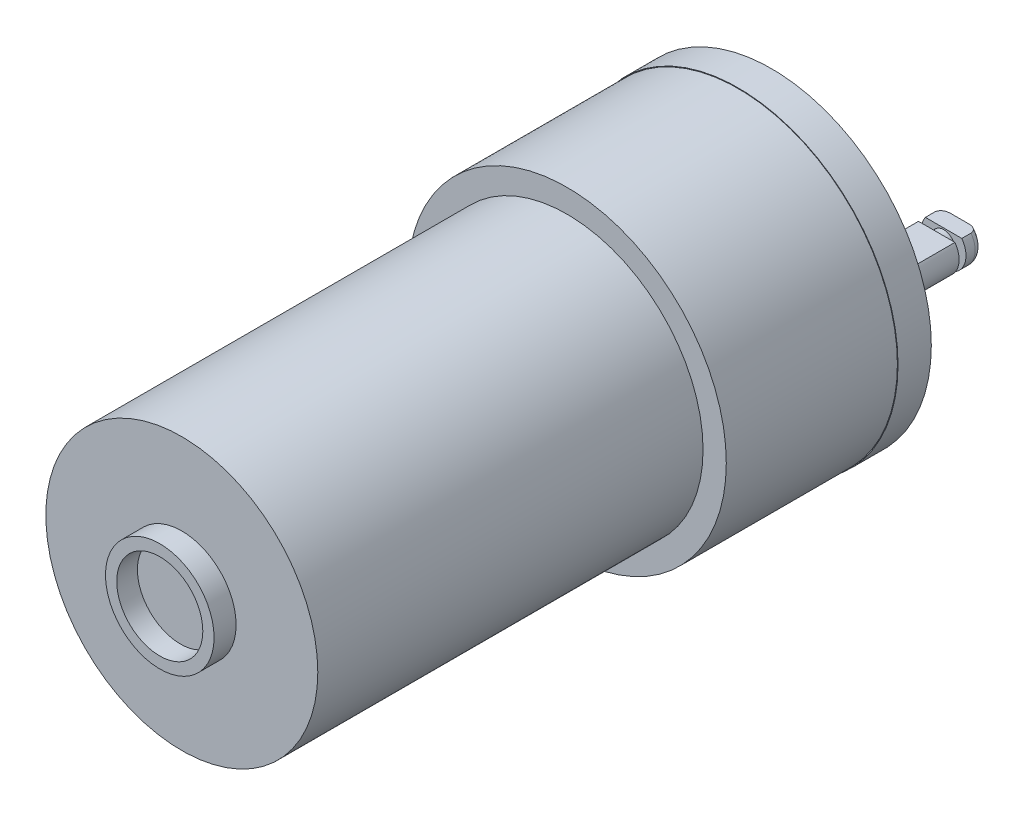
ISO-10303-21;
HEADER;
FILE_DESCRIPTION(('STEP AP214'),'2;1');
FILE_NAME('part.step','',(''),(''),'','','');
FILE_SCHEMA(('AUTOMOTIVE_DESIGN { 1 0 10303 214 1 1 1 1 }'));
ENDSEC;
DATA;
#1=APPLICATION_CONTEXT('core data for automotive mechanical design processes');
#2=APPLICATION_PROTOCOL_DEFINITION('international standard','automotive_design',2000,#1);
#3=PRODUCT_CONTEXT('',#1,'mechanical');
#4=PRODUCT('Part','Part','',(#3));
#5=PRODUCT_RELATED_PRODUCT_CATEGORY('part','',(#4));
#6=PRODUCT_DEFINITION_FORMATION('','',#4);
#7=PRODUCT_DEFINITION_CONTEXT('part definition',#1,'design');
#8=PRODUCT_DEFINITION('design','',#6,#7);
#9=PRODUCT_DEFINITION_SHAPE('','',#8);
#10=(LENGTH_UNIT() NAMED_UNIT(*) SI_UNIT(.MILLI.,.METRE.));
#11=(NAMED_UNIT(*) PLANE_ANGLE_UNIT() SI_UNIT($,.RADIAN.));
#12=(NAMED_UNIT(*) SI_UNIT($,.STERADIAN.) SOLID_ANGLE_UNIT());
#13=UNCERTAINTY_MEASURE_WITH_UNIT(LENGTH_MEASURE(1.E-05),#10,'distance_accuracy_value','');
#14=(GEOMETRIC_REPRESENTATION_CONTEXT(3) GLOBAL_UNCERTAINTY_ASSIGNED_CONTEXT((#13)) GLOBAL_UNIT_ASSIGNED_CONTEXT((#10,
#11,#12)) REPRESENTATION_CONTEXT('',''));
#15=CARTESIAN_POINT('',(0.,0.,0.));
#16=DIRECTION('',(0.,0.,1.));
#17=DIRECTION('',(1.,0.,0.));
#18=AXIS2_PLACEMENT_3D('',#15,#16,#17);
#19=CARTESIAN_POINT('',(13.4272857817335,-4.39654103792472,-67.563892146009));
#20=DIRECTION('',(0.,0.,-1.));
#21=DIRECTION('',(-1.,0.,0.));
#22=AXIS2_PLACEMENT_3D('',#19,#20,#21);
#23=PLANE('',#22);
#24=CARTESIAN_POINT('',(13.4272857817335,-4.39654103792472,-67.563892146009));
#25=DIRECTION('',(0.,0.,-1.));
#26=DIRECTION('',(-1.,0.,0.));
#27=AXIS2_PLACEMENT_3D('',#24,#25,#26);
#28=CIRCLE('',#27,2.7305);
#29=CARTESIAN_POINT('',(10.6967857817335,-4.39654103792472,-67.563892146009));
#30=VERTEX_POINT('',#29);
#31=EDGE_CURVE('E411',#30,#30,#28,.T.);
#32=ORIENTED_EDGE('',*,*,#31,.T.);
#33=EDGE_LOOP('',(#32));
#34=FACE_BOUND('',#33,.T.);
#35=DIRECTION('',(1.,0.,0.));
#36=VECTOR('',#35,1.);
#37=CARTESIAN_POINT('',(13.4272857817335,-4.90454103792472,-67.563892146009));
#38=LINE('',#37,#36);
#39=CARTESIAN_POINT('',(11.8397857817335,-4.90454103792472,-67.563892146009));
#40=VERTEX_POINT('',#39);
#41=CARTESIAN_POINT('',(12.9192857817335,-4.90454103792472,-67.563892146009));
#42=VERTEX_POINT('',#41);
#43=EDGE_CURVE('E98',#40,#42,#38,.T.);
#44=ORIENTED_EDGE('',*,*,#43,.T.);
#45=DIRECTION('',(0.,-1.,0.));
#46=VECTOR('',#45,1.);
#47=CARTESIAN_POINT('',(12.9192857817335,-4.39654103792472,-67.563892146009));
#48=LINE('',#47,#46);
#49=CARTESIAN_POINT('',(12.9192857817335,-5.98404103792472,-67.563892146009));
#50=VERTEX_POINT('',#49);
#51=EDGE_CURVE('E12',#42,#50,#48,.T.);
#52=ORIENTED_EDGE('',*,*,#51,.T.);
#53=DIRECTION('',(-1.,0.,0.));
#54=VECTOR('',#53,1.);
#55=CARTESIAN_POINT('',(13.4272857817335,-5.98404103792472,-67.563892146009));
#56=LINE('',#55,#54);
#57=CARTESIAN_POINT('',(13.9352857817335,-5.98404103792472,-67.563892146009));
#58=VERTEX_POINT('',#57);
#59=EDGE_CURVE('E1312',#58,#50,#56,.T.);
#60=ORIENTED_EDGE('',*,*,#59,.F.);
#61=DIRECTION('',(0.,-1.,0.));
#62=VECTOR('',#61,1.);
#63=CARTESIAN_POINT('',(13.9352857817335,-4.39654103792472,-67.563892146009));
#64=LINE('',#63,#62);
#65=CARTESIAN_POINT('',(13.9352857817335,-4.90454103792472,-67.563892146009));
#66=VERTEX_POINT('',#65);
#67=EDGE_CURVE('E1310',#66,#58,#64,.T.);
#68=ORIENTED_EDGE('',*,*,#67,.F.);
#69=DIRECTION('',(1.,0.,0.));
#70=VECTOR('',#69,1.);
#71=CARTESIAN_POINT('',(13.4272857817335,-4.90454103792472,-67.563892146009));
#72=LINE('',#71,#70);
#73=CARTESIAN_POINT('',(15.0147857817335,-4.90454103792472,-67.563892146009));
#74=VERTEX_POINT('',#73);
#75=EDGE_CURVE('E1302',#66,#74,#72,.T.);
#76=ORIENTED_EDGE('',*,*,#75,.T.);
#77=DIRECTION('',(0.,-1.,0.));
#78=VECTOR('',#77,1.);
#79=CARTESIAN_POINT('',(15.0147857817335,-4.39654103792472,-67.563892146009));
#80=LINE('',#79,#78);
#81=CARTESIAN_POINT('',(15.0147857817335,-3.88854103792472,-67.563892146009));
#82=VERTEX_POINT('',#81);
#83=EDGE_CURVE('E1300',#82,#74,#80,.T.);
#84=ORIENTED_EDGE('',*,*,#83,.F.);
#85=DIRECTION('',(1.,0.,0.));
#86=VECTOR('',#85,1.);
#87=CARTESIAN_POINT('',(13.4272857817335,-3.88854103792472,-67.563892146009));
#88=LINE('',#87,#86);
#89=CARTESIAN_POINT('',(13.9352857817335,-3.88854103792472,-67.563892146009));
#90=VERTEX_POINT('',#89);
#91=EDGE_CURVE('E1298',#90,#82,#88,.T.);
#92=ORIENTED_EDGE('',*,*,#91,.F.);
#93=DIRECTION('',(0.,-1.,0.));
#94=VECTOR('',#93,1.);
#95=CARTESIAN_POINT('',(13.9352857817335,-4.39654103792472,-67.563892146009));
#96=LINE('',#95,#94);
#97=CARTESIAN_POINT('',(13.9352857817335,-2.80904103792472,-67.563892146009));
#98=VERTEX_POINT('',#97);
#99=EDGE_CURVE('E1296',#98,#90,#96,.T.);
#100=ORIENTED_EDGE('',*,*,#99,.F.);
#101=DIRECTION('',(-1.,0.,0.));
#102=VECTOR('',#101,1.);
#103=CARTESIAN_POINT('',(13.4272857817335,-2.80904103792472,-67.563892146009));
#104=LINE('',#103,#102);
#105=CARTESIAN_POINT('',(12.9192857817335,-2.80904103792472,-67.563892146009));
#106=VERTEX_POINT('',#105);
#107=EDGE_CURVE('E297',#98,#106,#104,.T.);
#108=ORIENTED_EDGE('',*,*,#107,.T.);
#109=DIRECTION('',(0.,-1.,0.));
#110=VECTOR('',#109,1.);
#111=CARTESIAN_POINT('',(12.9192857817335,-4.39654103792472,-67.563892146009));
#112=LINE('',#111,#110);
#113=CARTESIAN_POINT('',(12.9192857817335,-3.88854103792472,-67.563892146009));
#114=VERTEX_POINT('',#113);
#115=EDGE_CURVE('E1292',#106,#114,#112,.T.);
#116=ORIENTED_EDGE('',*,*,#115,.T.);
#117=DIRECTION('',(1.,0.,0.));
#118=VECTOR('',#117,1.);
#119=CARTESIAN_POINT('',(13.4272857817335,-3.88854103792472,-67.563892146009));
#120=LINE('',#119,#118);
#121=CARTESIAN_POINT('',(11.8397857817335,-3.88854103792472,-67.563892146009));
#122=VERTEX_POINT('',#121);
#123=EDGE_CURVE('E1305',#122,#114,#120,.T.);
#124=ORIENTED_EDGE('',*,*,#123,.F.);
#125=DIRECTION('',(0.,-1.,0.));
#126=VECTOR('',#125,1.);
#127=CARTESIAN_POINT('',(11.8397857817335,-4.39654103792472,-67.563892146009));
#128=LINE('',#127,#126);
#129=EDGE_CURVE('E1307',#122,#40,#128,.T.);
#130=ORIENTED_EDGE('',*,*,#129,.T.);
#131=EDGE_LOOP('',(#44,#52,#60,#68,#76,#84,#92,#100,#108,#116,#124,#130));
#132=FACE_BOUND('',#131,.T.);
#133=ADVANCED_FACE('F88',(#34,#132),#23,.T.);
#134=CARTESIAN_POINT('',(0.,-8.53714933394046,-88.518892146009));
#135=DIRECTION('',(0.,0.,1.));
#136=DIRECTION('',(1.,0.,0.));
#137=AXIS2_PLACEMENT_3D('',#134,#135,#136);
#138=CYLINDRICAL_SURFACE('',#137,2.4765);
#139=CARTESIAN_POINT('',(0.,-8.53714933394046,-67.690892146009));
#140=DIRECTION('',(0.,0.,-1.));
#141=DIRECTION('',(-1.,0.,0.));
#142=AXIS2_PLACEMENT_3D('',#139,#140,#141);
#143=CIRCLE('',#142,2.4765);
#144=CARTESIAN_POINT('',(-2.4765,-8.53714933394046,-67.690892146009));
#145=VERTEX_POINT('',#144);
#146=EDGE_CURVE('E446',#145,#145,#143,.T.);
#147=ORIENTED_EDGE('',*,*,#146,.T.);
#148=EDGE_LOOP('',(#147));
#149=FACE_BOUND('',#148,.T.);
#150=CARTESIAN_POINT('',(0.,-8.53714933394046,-85.978892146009));
#151=DIRECTION('',(0.,0.,-1.));
#152=DIRECTION('',(-1.,0.,0.));
#153=AXIS2_PLACEMENT_3D('',#150,#151,#152);
#154=CIRCLE('',#153,2.4765);
#155=CARTESIAN_POINT('',(2.0183013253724,-7.10204933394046,-85.978892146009));
#156=VERTEX_POINT('',#155);
#157=CARTESIAN_POINT('',(-2.0183013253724,-7.10204933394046,-85.978892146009));
#158=VERTEX_POINT('',#157);
#159=EDGE_CURVE('E430',#156,#158,#154,.T.);
#160=ORIENTED_EDGE('',*,*,#159,.F.);
#161=DIRECTION('',(0.,0.,-1.));
#162=VECTOR('',#161,1.);
#163=CARTESIAN_POINT('',(2.0183013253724,-7.10204933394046,-76.834892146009));
#164=LINE('',#163,#162);
#165=CARTESIAN_POINT('',(2.0183013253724,-7.10204933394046,-76.834892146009));
#166=VERTEX_POINT('',#165);
#167=EDGE_CURVE('E448',#166,#156,#164,.T.);
#168=ORIENTED_EDGE('',*,*,#167,.F.);
#169=CARTESIAN_POINT('',(0.,-8.53714933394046,-76.834892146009));
#170=DIRECTION('',(0.,0.,-1.));
#171=DIRECTION('',(-1.,0.,0.));
#172=AXIS2_PLACEMENT_3D('',#169,#170,#171);
#173=CIRCLE('',#172,2.4765);
#174=CARTESIAN_POINT('',(-2.0183013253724,-7.10204933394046,-76.834892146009));
#175=VERTEX_POINT('',#174);
#176=EDGE_CURVE('E435',#175,#166,#173,.T.);
#177=ORIENTED_EDGE('',*,*,#176,.F.);
#178=DIRECTION('',(0.,0.,-1.));
#179=VECTOR('',#178,1.);
#180=CARTESIAN_POINT('',(-2.0183013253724,-7.10204933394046,-76.834892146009));
#181=LINE('',#180,#179);
#182=EDGE_CURVE('E443',#175,#158,#181,.T.);
#183=ORIENTED_EDGE('',*,*,#182,.T.);
#184=EDGE_LOOP('',(#160,#168,#177,#183));
#185=FACE_BOUND('',#184,.T.);
#186=ADVANCED_FACE('F559',(#149,#185),#138,.T.);
#187=CARTESIAN_POINT('',(2.0183013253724,-7.10204933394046,-76.834892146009));
#188=DIRECTION('',(0.,-1.,0.));
#189=DIRECTION('',(0.,0.,-1.));
#190=AXIS2_PLACEMENT_3D('',#187,#188,#189);
#191=PLANE('',#190);
#192=DIRECTION('',(1.,0.,0.));
#193=VECTOR('',#192,1.);
#194=CARTESIAN_POINT('',(2.0183013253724,-7.10204933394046,-85.978892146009));
#195=LINE('',#194,#193);
#196=EDGE_CURVE('E706',#158,#156,#195,.T.);
#197=ORIENTED_EDGE('',*,*,#196,.F.);
#198=ORIENTED_EDGE('',*,*,#182,.F.);
#199=DIRECTION('',(-1.,0.,0.));
#200=VECTOR('',#199,1.);
#201=CARTESIAN_POINT('',(2.0183013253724,-7.10204933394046,-76.834892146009));
#202=LINE('',#201,#200);
#203=EDGE_CURVE('E437',#166,#175,#202,.T.);
#204=ORIENTED_EDGE('',*,*,#203,.F.);
#205=ORIENTED_EDGE('',*,*,#167,.T.);
#206=EDGE_LOOP('',(#197,#198,#204,#205));
#207=FACE_BOUND('',#206,.T.);
#208=ADVANCED_FACE('F546',(#207),#191,.F.);
#209=CARTESIAN_POINT('',(1.23536291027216E-13,-17.6911,-67.690892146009));
#210=DIRECTION('',(0.,0.,-1.));
#211=DIRECTION('',(-1.,0.,0.));
#212=AXIS2_PLACEMENT_3D('',#209,#210,#211);
#213=PLANE('',#212);
#214=CARTESIAN_POINT('',(13.4272857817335,-4.39654103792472,-67.690892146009));
#215=DIRECTION('',(0.,0.,-1.));
#216=DIRECTION('',(-1.,0.,0.));
#217=AXIS2_PLACEMENT_3D('',#214,#215,#216);
#218=CIRCLE('',#217,2.7305);
#219=CARTESIAN_POINT('',(10.6967857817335,-4.39654103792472,-67.690892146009));
#220=VERTEX_POINT('',#219);
#221=EDGE_CURVE('E412',#220,#220,#218,.T.);
#222=ORIENTED_EDGE('',*,*,#221,.F.);
#223=EDGE_LOOP('',(#222));
#224=FACE_BOUND('',#223,.T.);
#225=CARTESIAN_POINT('',(-12.1501114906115,7.21085066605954,-67.690892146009));
#226=DIRECTION('',(0.,0.,-1.));
#227=DIRECTION('',(-1.,0.,0.));
#228=AXIS2_PLACEMENT_3D('',#225,#226,#227);
#229=CIRCLE('',#228,2.7305);
#230=CARTESIAN_POINT('',(-14.8806114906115,7.21085066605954,-67.690892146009));
#231=VERTEX_POINT('',#230);
#232=EDGE_CURVE('E415',#231,#231,#229,.T.);
#233=ORIENTED_EDGE('',*,*,#232,.F.);
#234=EDGE_LOOP('',(#233));
#235=FACE_BOUND('',#234,.T.);
#236=CARTESIAN_POINT('',(0.,-8.53714933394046,-67.690892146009));
#237=DIRECTION('',(0.,0.,-1.));
#238=DIRECTION('',(-1.,0.,0.));
#239=AXIS2_PLACEMENT_3D('',#236,#237,#238);
#240=CIRCLE('',#239,5.9944);
#241=CARTESIAN_POINT('',(-5.9944,-8.53714933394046,-67.690892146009));
#242=VERTEX_POINT('',#241);
#243=EDGE_CURVE('E453',#242,#242,#240,.T.);
#244=ORIENTED_EDGE('',*,*,#243,.F.);
#245=EDGE_LOOP('',(#244));
#246=FACE_BOUND('',#245,.T.);
#247=CARTESIAN_POINT('',(10.3759,-8.53714933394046,-67.690892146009));
#248=DIRECTION('',(0.,0.,-1.));
#249=DIRECTION('',(-1.,0.,0.));
#250=AXIS2_PLACEMENT_3D('',#247,#248,#249);
#251=CIRCLE('',#250,1.25);
#252=CARTESIAN_POINT('',(9.1259,-8.53714933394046,-67.690892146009));
#253=VERTEX_POINT('',#252);
#254=EDGE_CURVE('E460',#253,#253,#251,.T.);
#255=ORIENTED_EDGE('',*,*,#254,.F.);
#256=EDGE_LOOP('',(#255));
#257=FACE_BOUND('',#256,.T.);
#258=CARTESIAN_POINT('',(0.,13.4366,-67.690892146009));
#259=DIRECTION('',(0.,0.,-1.));
#260=DIRECTION('',(-1.,0.,0.));
#261=AXIS2_PLACEMENT_3D('',#258,#259,#260);
#262=CIRCLE('',#261,1.25);
#263=CARTESIAN_POINT('',(-1.25,13.4366,-67.690892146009));
#264=VERTEX_POINT('',#263);
#265=EDGE_CURVE('E468',#264,#264,#262,.T.);
#266=ORIENTED_EDGE('',*,*,#265,.F.);
#267=EDGE_LOOP('',(#266));
#268=FACE_BOUND('',#267,.T.);
#269=CARTESIAN_POINT('',(-10.3759,-8.53714933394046,-67.690892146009));
#270=DIRECTION('',(0.,0.,-1.));
#271=DIRECTION('',(-1.,0.,0.));
#272=AXIS2_PLACEMENT_3D('',#269,#270,#271);
#273=CIRCLE('',#272,1.25);
#274=CARTESIAN_POINT('',(-11.6259,-8.53714933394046,-67.690892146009));
#275=VERTEX_POINT('',#274);
#276=EDGE_CURVE('E474',#275,#275,#273,.T.);
#277=ORIENTED_EDGE('',*,*,#276,.F.);
#278=EDGE_LOOP('',(#277));
#279=FACE_BOUND('',#278,.T.);
#280=CARTESIAN_POINT('',(0.,0.,-67.690892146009));
#281=DIRECTION('',(0.,0.,1.));
#282=DIRECTION('',(1.,0.,0.));
#283=AXIS2_PLACEMENT_3D('',#280,#281,#282);
#284=CIRCLE('',#283,17.6911);
#285=CARTESIAN_POINT('',(17.6911,0.,-67.690892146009));
#286=VERTEX_POINT('',#285);
#287=EDGE_CURVE('E519',#286,#286,#284,.T.);
#288=ORIENTED_EDGE('',*,*,#287,.F.);
#289=EDGE_LOOP('',(#288));
#290=FACE_BOUND('',#289,.T.);
#291=ADVANCED_FACE('F656',(#224,#235,#246,#257,#268,#279,#290),#213,.T.);
#292=CARTESIAN_POINT('',(0.,0.,0.));
#293=DIRECTION('',(0.,0.,1.));
#294=DIRECTION('',(1.,0.,0.));
#295=AXIS2_PLACEMENT_3D('',#292,#293,#294);
#296=CYLINDRICAL_SURFACE('',#295,17.6911);
#297=ORIENTED_EDGE('',*,*,#287,.T.);
#298=EDGE_LOOP('',(#297));
#299=FACE_BOUND('',#298,.T.);
#300=CARTESIAN_POINT('',(0.,0.,-64.007892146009));
#301=DIRECTION('',(0.,0.,1.));
#302=DIRECTION('',(1.,0.,0.));
#303=AXIS2_PLACEMENT_3D('',#300,#301,#302);
#304=CIRCLE('',#303,17.6911);
#305=CARTESIAN_POINT('',(17.6911,0.,-64.007892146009));
#306=VERTEX_POINT('',#305);
#307=EDGE_CURVE('E516',#306,#306,#304,.T.);
#308=ORIENTED_EDGE('',*,*,#307,.F.);
#309=EDGE_LOOP('',(#308));
#310=FACE_BOUND('',#309,.T.);
#311=ADVANCED_FACE('F653',(#299,#310),#296,.T.);
#312=CARTESIAN_POINT('',(1.23536291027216E-13,-17.6911,-64.007892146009));
#313=DIRECTION('',(0.,0.,1.));
#314=DIRECTION('',(1.,0.,0.));
#315=AXIS2_PLACEMENT_3D('',#312,#313,#314);
#316=PLANE('',#315);
#317=ORIENTED_EDGE('',*,*,#307,.T.);
#318=EDGE_LOOP('',(#317));
#319=FACE_BOUND('',#318,.T.);
#320=CARTESIAN_POINT('',(0.,0.,-64.007892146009));
#321=DIRECTION('',(0.,0.,1.));
#322=DIRECTION('',(1.,0.,0.));
#323=AXIS2_PLACEMENT_3D('',#320,#321,#322);
#324=CIRCLE('',#323,17.62125);
#325=CARTESIAN_POINT('',(17.62125,0.,-64.007892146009));
#326=VERTEX_POINT('',#325);
#327=EDGE_CURVE('E513',#326,#326,#324,.T.);
#328=ORIENTED_EDGE('',*,*,#327,.F.);
#329=EDGE_LOOP('',(#328));
#330=FACE_BOUND('',#329,.T.);
#331=ADVANCED_FACE('F649',(#319,#330),#316,.T.);
#332=CARTESIAN_POINT('',(0.,0.,0.));
#333=DIRECTION('',(0.,0.,1.));
#334=DIRECTION('',(1.,0.,0.));
#335=AXIS2_PLACEMENT_3D('',#332,#333,#334);
#336=CYLINDRICAL_SURFACE('',#335,17.62125);
#337=ORIENTED_EDGE('',*,*,#327,.T.);
#338=EDGE_LOOP('',(#337));
#339=FACE_BOUND('',#338,.T.);
#340=CARTESIAN_POINT('',(0.,0.,-45.0723));
#341=DIRECTION('',(0.,0.,1.));
#342=DIRECTION('',(1.,0.,0.));
#343=AXIS2_PLACEMENT_3D('',#340,#341,#342);
#344=CIRCLE('',#343,17.62125);
#345=CARTESIAN_POINT('',(17.62125,0.,-45.0723));
#346=VERTEX_POINT('',#345);
#347=EDGE_CURVE('E510',#346,#346,#344,.T.);
#348=ORIENTED_EDGE('',*,*,#347,.F.);
#349=EDGE_LOOP('',(#348));
#350=FACE_BOUND('',#349,.T.);
#351=ADVANCED_FACE('F645',(#339,#350),#336,.T.);
#352=CARTESIAN_POINT('',(1.05090096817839E-13,-15.0495,-45.0723));
#353=DIRECTION('',(0.,0.,1.));
#354=DIRECTION('',(1.,0.,0.));
#355=AXIS2_PLACEMENT_3D('',#352,#353,#354);
#356=PLANE('',#355);
#357=ORIENTED_EDGE('',*,*,#347,.T.);
#358=EDGE_LOOP('',(#357));
#359=FACE_BOUND('',#358,.T.);
#360=CARTESIAN_POINT('',(0.,0.,-45.0723));
#361=DIRECTION('',(0.,0.,1.));
#362=DIRECTION('',(1.,0.,0.));
#363=AXIS2_PLACEMENT_3D('',#360,#361,#362);
#364=CIRCLE('',#363,15.0495);
#365=CARTESIAN_POINT('',(15.0495,0.,-45.0723));
#366=VERTEX_POINT('',#365);
#367=EDGE_CURVE('E507',#366,#366,#364,.T.);
#368=ORIENTED_EDGE('',*,*,#367,.F.);
#369=EDGE_LOOP('',(#368));
#370=FACE_BOUND('',#369,.T.);
#371=ADVANCED_FACE('F641',(#359,#370),#356,.T.);
#372=CARTESIAN_POINT('',(0.,0.,0.));
#373=DIRECTION('',(0.,0.,1.));
#374=DIRECTION('',(1.,0.,0.));
#375=AXIS2_PLACEMENT_3D('',#372,#373,#374);
#376=CYLINDRICAL_SURFACE('',#375,15.0495);
#377=ORIENTED_EDGE('',*,*,#367,.T.);
#378=EDGE_LOOP('',(#377));
#379=FACE_BOUND('',#378,.T.);
#380=CARTESIAN_POINT('',(0.,0.,-2.4384));
#381=DIRECTION('',(0.,0.,1.));
#382=DIRECTION('',(1.,0.,0.));
#383=AXIS2_PLACEMENT_3D('',#380,#381,#382);
#384=CIRCLE('',#383,15.0495);
#385=CARTESIAN_POINT('',(15.0495,0.,-2.4384));
#386=VERTEX_POINT('',#385);
#387=EDGE_CURVE('E504',#386,#386,#384,.T.);
#388=ORIENTED_EDGE('',*,*,#387,.F.);
#389=EDGE_LOOP('',(#388));
#390=FACE_BOUND('',#389,.T.);
#391=ADVANCED_FACE('F637',(#379,#390),#376,.T.);
#392=CARTESIAN_POINT('',(0.,-6.0071,-2.4384));
#393=DIRECTION('',(0.,0.,1.));
#394=DIRECTION('',(1.,0.,0.));
#395=AXIS2_PLACEMENT_3D('',#392,#393,#394);
#396=PLANE('',#395);
#397=ORIENTED_EDGE('',*,*,#387,.T.);
#398=EDGE_LOOP('',(#397));
#399=FACE_BOUND('',#398,.T.);
#400=CARTESIAN_POINT('',(0.,0.,-2.4384));
#401=DIRECTION('',(0.,0.,1.));
#402=DIRECTION('',(1.,0.,0.));
#403=AXIS2_PLACEMENT_3D('',#400,#401,#402);
#404=CIRCLE('',#403,6.0071);
#405=CARTESIAN_POINT('',(6.0071,0.,-2.4384));
#406=VERTEX_POINT('',#405);
#407=EDGE_CURVE('E501',#406,#406,#404,.T.);
#408=ORIENTED_EDGE('',*,*,#407,.F.);
#409=EDGE_LOOP('',(#408));
#410=FACE_BOUND('',#409,.T.);
#411=ADVANCED_FACE('F633',(#399,#410),#396,.T.);
#412=CARTESIAN_POINT('',(0.,0.,0.));
#413=DIRECTION('',(0.,0.,1.));
#414=DIRECTION('',(1.,0.,0.));
#415=AXIS2_PLACEMENT_3D('',#412,#413,#414);
#416=CYLINDRICAL_SURFACE('',#415,6.0071);
#417=ORIENTED_EDGE('',*,*,#407,.T.);
#418=EDGE_LOOP('',(#417));
#419=FACE_BOUND('',#418,.T.);
#420=CARTESIAN_POINT('',(0.,0.,0.));
#421=DIRECTION('',(0.,0.,1.));
#422=DIRECTION('',(1.,0.,0.));
#423=AXIS2_PLACEMENT_3D('',#420,#421,#422);
#424=CIRCLE('',#423,6.0071);
#425=CARTESIAN_POINT('',(6.0071,0.,0.));
#426=VERTEX_POINT('',#425);
#427=EDGE_CURVE('E498',#426,#426,#424,.T.);
#428=ORIENTED_EDGE('',*,*,#427,.F.);
#429=EDGE_LOOP('',(#428));
#430=FACE_BOUND('',#429,.T.);
#431=ADVANCED_FACE('F629',(#419,#430),#416,.T.);
#432=CARTESIAN_POINT('',(0.,0.,0.));
#433=DIRECTION('',(0.,0.,1.));
#434=DIRECTION('',(1.,0.,0.));
#435=AXIS2_PLACEMENT_3D('',#432,#433,#434);
#436=PLANE('',#435);
#437=CARTESIAN_POINT('',(0.,0.,0.));
#438=DIRECTION('',(0.,0.,1.));
#439=DIRECTION('',(1.,0.,0.));
#440=AXIS2_PLACEMENT_3D('',#437,#438,#439);
#441=CIRCLE('',#440,4.7625);
#442=CARTESIAN_POINT('',(4.7625,0.,0.));
#443=VERTEX_POINT('',#442);
#444=EDGE_CURVE('E1342',#443,#443,#441,.T.);
#445=ORIENTED_EDGE('',*,*,#444,.F.);
#446=EDGE_LOOP('',(#445));
#447=FACE_BOUND('',#446,.T.);
#448=ORIENTED_EDGE('',*,*,#427,.T.);
#449=EDGE_LOOP('',(#448));
#450=FACE_BOUND('',#449,.T.);
#451=ADVANCED_FACE('F596',(#447,#450),#436,.T.);
#452=CARTESIAN_POINT('',(-10.3759,-8.53714933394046,-56.565692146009));
#453=DIRECTION('',(0.,0.,-1.));
#454=DIRECTION('',(-1.,0.,0.));
#455=AXIS2_PLACEMENT_3D('',#452,#453,#454);
#456=CONICAL_SURFACE('',#455,1.25,1.02974425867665);
#457=CARTESIAN_POINT('',(-10.3759,-8.53714933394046,-55.8146163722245));
#458=VERTEX_POINT('',#457);
#459=VERTEX_LOOP('',#458);
#460=FACE_BOUND('',#459,.T.);
#461=CARTESIAN_POINT('',(-10.3759,-8.53714933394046,-56.565692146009));
#462=DIRECTION('',(0.,0.,-1.));
#463=DIRECTION('',(-1.,0.,0.));
#464=AXIS2_PLACEMENT_3D('',#461,#462,#463);
#465=CIRCLE('',#464,1.25);
#466=CARTESIAN_POINT('',(-11.6259,-8.53714933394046,-56.565692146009));
#467=VERTEX_POINT('',#466);
#468=EDGE_CURVE('E477',#467,#467,#465,.T.);
#469=ORIENTED_EDGE('',*,*,#468,.T.);
#470=EDGE_LOOP('',(#469));
#471=FACE_BOUND('',#470,.T.);
#472=ADVANCED_FACE('F592',(#460,#471),#456,.F.);
#473=CARTESIAN_POINT('',(-10.3759,-8.53714933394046,-67.690892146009));
#474=DIRECTION('',(0.,0.,-1.));
#475=DIRECTION('',(-1.,0.,0.));
#476=AXIS2_PLACEMENT_3D('',#473,#474,#475);
#477=CYLINDRICAL_SURFACE('',#476,1.25);
#478=ORIENTED_EDGE('',*,*,#468,.F.);
#479=EDGE_LOOP('',(#478));
#480=FACE_BOUND('',#479,.T.);
#481=ORIENTED_EDGE('',*,*,#276,.T.);
#482=EDGE_LOOP('',(#481));
#483=FACE_BOUND('',#482,.T.);
#484=ADVANCED_FACE('F588',(#480,#483),#477,.F.);
#485=CARTESIAN_POINT('',(0.,13.4366,-56.565692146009));
#486=DIRECTION('',(0.,0.,-1.));
#487=DIRECTION('',(-1.,0.,0.));
#488=AXIS2_PLACEMENT_3D('',#485,#486,#487);
#489=CONICAL_SURFACE('',#488,1.25,1.02974425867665);
#490=CARTESIAN_POINT('',(0.,13.4366,-55.8146163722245));
#491=VERTEX_POINT('',#490);
#492=VERTEX_LOOP('',#491);
#493=FACE_BOUND('',#492,.T.);
#494=CARTESIAN_POINT('',(0.,13.4366,-56.565692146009));
#495=DIRECTION('',(0.,0.,-1.));
#496=DIRECTION('',(-1.,0.,0.));
#497=AXIS2_PLACEMENT_3D('',#494,#495,#496);
#498=CIRCLE('',#497,1.25);
#499=CARTESIAN_POINT('',(-1.25,13.4366,-56.565692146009));
#500=VERTEX_POINT('',#499);
#501=EDGE_CURVE('E471',#500,#500,#498,.T.);
#502=ORIENTED_EDGE('',*,*,#501,.T.);
#503=EDGE_LOOP('',(#502));
#504=FACE_BOUND('',#503,.T.);
#505=ADVANCED_FACE('F584',(#493,#504),#489,.F.);
#506=CARTESIAN_POINT('',(0.,13.4366,-67.690892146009));
#507=DIRECTION('',(0.,0.,-1.));
#508=DIRECTION('',(-1.,0.,0.));
#509=AXIS2_PLACEMENT_3D('',#506,#507,#508);
#510=CYLINDRICAL_SURFACE('',#509,1.25);
#511=ORIENTED_EDGE('',*,*,#501,.F.);
#512=EDGE_LOOP('',(#511));
#513=FACE_BOUND('',#512,.T.);
#514=ORIENTED_EDGE('',*,*,#265,.T.);
#515=EDGE_LOOP('',(#514));
#516=FACE_BOUND('',#515,.T.);
#517=ADVANCED_FACE('F580',(#513,#516),#510,.F.);
#518=CARTESIAN_POINT('',(10.3759,-8.53714933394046,-56.565692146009));
#519=DIRECTION('',(0.,0.,-1.));
#520=DIRECTION('',(-1.,0.,0.));
#521=AXIS2_PLACEMENT_3D('',#518,#519,#520);
#522=CONICAL_SURFACE('',#521,1.25,1.02974425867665);
#523=CARTESIAN_POINT('',(10.3759,-8.53714933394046,-55.8146163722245));
#524=VERTEX_POINT('',#523);
#525=VERTEX_LOOP('',#524);
#526=FACE_BOUND('',#525,.T.);
#527=CARTESIAN_POINT('',(10.3759,-8.53714933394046,-56.565692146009));
#528=DIRECTION('',(0.,0.,-1.));
#529=DIRECTION('',(-1.,0.,0.));
#530=AXIS2_PLACEMENT_3D('',#527,#528,#529);
#531=CIRCLE('',#530,1.25);
#532=CARTESIAN_POINT('',(9.1259,-8.53714933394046,-56.565692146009));
#533=VERTEX_POINT('',#532);
#534=EDGE_CURVE('E465',#533,#533,#531,.T.);
#535=ORIENTED_EDGE('',*,*,#534,.T.);
#536=EDGE_LOOP('',(#535));
#537=FACE_BOUND('',#536,.T.);
#538=ADVANCED_FACE('F576',(#526,#537),#522,.F.);
#539=CARTESIAN_POINT('',(10.3759,-8.53714933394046,-67.690892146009));
#540=DIRECTION('',(0.,0.,-1.));
#541=DIRECTION('',(-1.,0.,0.));
#542=AXIS2_PLACEMENT_3D('',#539,#540,#541);
#543=CYLINDRICAL_SURFACE('',#542,1.25);
#544=ORIENTED_EDGE('',*,*,#534,.F.);
#545=EDGE_LOOP('',(#544));
#546=FACE_BOUND('',#545,.T.);
#547=ORIENTED_EDGE('',*,*,#254,.T.);
#548=EDGE_LOOP('',(#547));
#549=FACE_BOUND('',#548,.T.);
#550=ADVANCED_FACE('F572',(#546,#549),#543,.F.);
#551=CARTESIAN_POINT('',(0.,-8.53714933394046,-69.468892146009));
#552=DIRECTION('',(0.,0.,1.));
#553=DIRECTION('',(1.,0.,0.));
#554=AXIS2_PLACEMENT_3D('',#551,#552,#553);
#555=CYLINDRICAL_SURFACE('',#554,2.54);
#556=CARTESIAN_POINT('',(0.,-8.53714933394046,-69.468892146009));
#557=DIRECTION('',(0.,0.,-1.));
#558=DIRECTION('',(-1.,0.,0.));
#559=AXIS2_PLACEMENT_3D('',#556,#557,#558);
#560=CIRCLE('',#559,2.54);
#561=CARTESIAN_POINT('',(-2.54,-8.53714933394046,-69.468892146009));
#562=VERTEX_POINT('',#561);
#563=EDGE_CURVE('E454',#562,#562,#560,.T.);
#564=ORIENTED_EDGE('',*,*,#563,.T.);
#565=EDGE_LOOP('',(#564));
#566=FACE_BOUND('',#565,.T.);
#567=CARTESIAN_POINT('',(0.,-8.53714933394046,-67.690892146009));
#568=DIRECTION('',(0.,0.,-1.));
#569=DIRECTION('',(-1.,0.,0.));
#570=AXIS2_PLACEMENT_3D('',#567,#568,#569);
#571=CIRCLE('',#570,2.54);
#572=CARTESIAN_POINT('',(-2.54,-8.53714933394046,-67.690892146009));
#573=VERTEX_POINT('',#572);
#574=EDGE_CURVE('E522',#573,#573,#571,.F.);
#575=ORIENTED_EDGE('',*,*,#574,.T.);
#576=EDGE_LOOP('',(#575));
#577=FACE_BOUND('',#576,.T.);
#578=ADVANCED_FACE('F568',(#566,#577),#555,.F.);
#579=CARTESIAN_POINT('',(0.,-8.53714933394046,-69.468892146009));
#580=DIRECTION('',(0.,0.,1.));
#581=DIRECTION('',(1.,0.,0.));
#582=AXIS2_PLACEMENT_3D('',#579,#580,#581);
#583=CYLINDRICAL_SURFACE('',#582,5.9944);
#584=CARTESIAN_POINT('',(0.,-8.53714933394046,-69.468892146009));
#585=DIRECTION('',(0.,0.,-1.));
#586=DIRECTION('',(-1.,0.,0.));
#587=AXIS2_PLACEMENT_3D('',#584,#585,#586);
#588=CIRCLE('',#587,5.9944);
#589=CARTESIAN_POINT('',(-5.9944,-8.53714933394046,-69.468892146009));
#590=VERTEX_POINT('',#589);
#591=EDGE_CURVE('E457',#590,#590,#588,.T.);
#592=ORIENTED_EDGE('',*,*,#591,.F.);
#593=EDGE_LOOP('',(#592));
#594=FACE_BOUND('',#593,.T.);
#595=ORIENTED_EDGE('',*,*,#243,.T.);
#596=EDGE_LOOP('',(#595));
#597=FACE_BOUND('',#596,.T.);
#598=ADVANCED_FACE('F564',(#594,#597),#583,.T.);
#599=CARTESIAN_POINT('',(0.,0.,-69.468892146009));
#600=DIRECTION('',(0.,0.,-1.));
#601=DIRECTION('',(-1.,0.,0.));
#602=AXIS2_PLACEMENT_3D('',#599,#600,#601);
#603=PLANE('',#602);
#604=ORIENTED_EDGE('',*,*,#563,.F.);
#605=EDGE_LOOP('',(#604));
#606=FACE_BOUND('',#605,.T.);
#607=ORIENTED_EDGE('',*,*,#591,.T.);
#608=EDGE_LOOP('',(#607));
#609=FACE_BOUND('',#608,.T.);
#610=ADVANCED_FACE('F560',(#606,#609),#603,.T.);
#611=ORIENTED_EDGE('',*,*,#146,.F.);
#612=EDGE_LOOP('',(#611));
#613=FACE_BOUND('',#612,.T.);
#614=ORIENTED_EDGE('',*,*,#574,.F.);
#615=EDGE_LOOP('',(#614));
#616=FACE_BOUND('',#615,.T.);
#617=ADVANCED_FACE('F563',(#613,#616),#213,.T.);
#618=CARTESIAN_POINT('',(0.,-8.53714933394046,-76.834892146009));
#619=DIRECTION('',(0.,0.,-1.));
#620=DIRECTION('',(-1.,0.,0.));
#621=AXIS2_PLACEMENT_3D('',#618,#619,#620);
#622=PLANE('',#621);
#623=ORIENTED_EDGE('',*,*,#176,.T.);
#624=ORIENTED_EDGE('',*,*,#203,.T.);
#625=EDGE_LOOP('',(#623,#624));
#626=FACE_BOUND('',#625,.T.);
#627=ADVANCED_FACE('F547',(#626),#622,.T.);
#628=CARTESIAN_POINT('',(0.,-8.53714933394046,-85.978892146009));
#629=DIRECTION('',(0.,0.,-1.));
#630=DIRECTION('',(-1.,0.,0.));
#631=AXIS2_PLACEMENT_3D('',#628,#629,#630);
#632=PLANE('',#631);
#633=CARTESIAN_POINT('',(0.,-8.53714933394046,-85.978892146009));
#634=DIRECTION('',(0.,0.,-1.));
#635=DIRECTION('',(-1.,0.,0.));
#636=AXIS2_PLACEMENT_3D('',#633,#634,#635);
#637=CIRCLE('',#636,1.27);
#638=CARTESIAN_POINT('',(-1.27,-8.53714933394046,-85.978892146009));
#639=VERTEX_POINT('',#638);
#640=EDGE_CURVE('E424',#639,#639,#637,.T.);
#641=ORIENTED_EDGE('',*,*,#640,.F.);
#642=EDGE_LOOP('',(#641));
#643=FACE_BOUND('',#642,.T.);
#644=ORIENTED_EDGE('',*,*,#196,.T.);
#645=ORIENTED_EDGE('',*,*,#159,.T.);
#646=EDGE_LOOP('',(#644,#645));
#647=FACE_BOUND('',#646,.T.);
#648=ADVANCED_FACE('F691',(#643,#647),#632,.T.);
#649=CARTESIAN_POINT('',(0.,-8.53714933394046,-86.740892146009));
#650=DIRECTION('',(0.,0.,-1.));
#651=DIRECTION('',(-1.,0.,0.));
#652=AXIS2_PLACEMENT_3D('',#649,#650,#651);
#653=PLANE('',#652);
#654=CARTESIAN_POINT('',(0.,-8.53714933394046,-86.740892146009));
#655=DIRECTION('',(0.,0.,-1.));
#656=DIRECTION('',(-1.,0.,0.));
#657=AXIS2_PLACEMENT_3D('',#654,#655,#656);
#658=CIRCLE('',#657,1.27);
#659=CARTESIAN_POINT('',(-1.27,-8.53714933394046,-86.740892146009));
#660=VERTEX_POINT('',#659);
#661=EDGE_CURVE('E421',#660,#660,#658,.T.);
#662=ORIENTED_EDGE('',*,*,#661,.T.);
#663=EDGE_LOOP('',(#662));
#664=FACE_BOUND('',#663,.T.);
#665=CARTESIAN_POINT('',(0.,-8.53714933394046,-86.740892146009));
#666=DIRECTION('',(0.,0.,-1.));
#667=DIRECTION('',(-1.,0.,0.));
#668=AXIS2_PLACEMENT_3D('',#665,#666,#667);
#669=CIRCLE('',#668,2.4765);
#670=CARTESIAN_POINT('',(2.0183013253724,-7.10204933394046,-86.740892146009));
#671=VERTEX_POINT('',#670);
#672=CARTESIAN_POINT('',(-2.0183013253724,-7.10204933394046,-86.740892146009));
#673=VERTEX_POINT('',#672);
#674=EDGE_CURVE('E427',#671,#673,#669,.T.);
#675=ORIENTED_EDGE('',*,*,#674,.F.);
#676=DIRECTION('',(1.,0.,0.));
#677=VECTOR('',#676,1.);
#678=CARTESIAN_POINT('',(2.0183013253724,-7.10204933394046,-86.740892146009));
#679=LINE('',#678,#677);
#680=EDGE_CURVE('E701',#673,#671,#679,.T.);
#681=ORIENTED_EDGE('',*,*,#680,.F.);
#682=EDGE_LOOP('',(#675,#681));
#683=FACE_BOUND('',#682,.T.);
#684=ADVANCED_FACE('F689',(#664,#683),#653,.F.);
#685=CARTESIAN_POINT('',(0.,-8.53714933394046,-85.978892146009));
#686=DIRECTION('',(0.,0.,-1.));
#687=DIRECTION('',(-1.,0.,0.));
#688=AXIS2_PLACEMENT_3D('',#685,#686,#687);
#689=CYLINDRICAL_SURFACE('',#688,1.27);
#690=CARTESIAN_POINT('',(-1.27,-8.53714933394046,-85.978892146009));
#691=CARTESIAN_POINT('',(-1.27,-8.53714933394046,-85.986829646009));
#692=CARTESIAN_POINT('',(-1.27,-8.53714933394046,-85.994767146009));
#693=CARTESIAN_POINT('',(-1.27,-8.53714933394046,-86.010642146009));
#694=CARTESIAN_POINT('',(-1.27,-8.53714933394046,-86.018579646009));
#695=CARTESIAN_POINT('',(-1.27,-8.53714933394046,-86.034454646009));
#696=CARTESIAN_POINT('',(-1.27,-8.53714933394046,-86.042392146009));
#697=CARTESIAN_POINT('',(-1.27,-8.53714933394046,-86.058267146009));
#698=CARTESIAN_POINT('',(-1.27,-8.53714933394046,-86.066204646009));
#699=CARTESIAN_POINT('',(-1.27,-8.53714933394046,-86.082079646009));
#700=CARTESIAN_POINT('',(-1.27,-8.53714933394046,-86.090017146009));
#701=CARTESIAN_POINT('',(-1.27,-8.53714933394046,-86.105892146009));
#702=CARTESIAN_POINT('',(-1.27,-8.53714933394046,-86.113829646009));
#703=CARTESIAN_POINT('',(-1.27,-8.53714933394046,-86.129704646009));
#704=CARTESIAN_POINT('',(-1.27,-8.53714933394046,-86.137642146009));
#705=CARTESIAN_POINT('',(-1.27,-8.53714933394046,-86.153517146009));
#706=CARTESIAN_POINT('',(-1.27,-8.53714933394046,-86.161454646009));
#707=CARTESIAN_POINT('',(-1.27,-8.53714933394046,-86.177329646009));
#708=CARTESIAN_POINT('',(-1.27,-8.53714933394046,-86.185267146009));
#709=CARTESIAN_POINT('',(-1.27,-8.53714933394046,-86.201142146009));
#710=CARTESIAN_POINT('',(-1.27,-8.53714933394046,-86.209079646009));
#711=CARTESIAN_POINT('',(-1.27,-8.53714933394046,-86.224954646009));
#712=CARTESIAN_POINT('',(-1.27,-8.53714933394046,-86.232892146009));
#713=CARTESIAN_POINT('',(-1.27,-8.53714933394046,-86.248767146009));
#714=CARTESIAN_POINT('',(-1.27,-8.53714933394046,-86.256704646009));
#715=CARTESIAN_POINT('',(-1.27,-8.53714933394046,-86.272579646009));
#716=CARTESIAN_POINT('',(-1.27,-8.53714933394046,-86.280517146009));
#717=CARTESIAN_POINT('',(-1.27,-8.53714933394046,-86.296392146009));
#718=CARTESIAN_POINT('',(-1.27,-8.53714933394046,-86.304329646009));
#719=CARTESIAN_POINT('',(-1.27,-8.53714933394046,-86.320204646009));
#720=CARTESIAN_POINT('',(-1.27,-8.53714933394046,-86.328142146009));
#721=CARTESIAN_POINT('',(-1.27,-8.53714933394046,-86.344017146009));
#722=CARTESIAN_POINT('',(-1.27,-8.53714933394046,-86.351954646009));
#723=CARTESIAN_POINT('',(-1.27,-8.53714933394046,-86.367829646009));
#724=CARTESIAN_POINT('',(-1.27,-8.53714933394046,-86.375767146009));
#725=CARTESIAN_POINT('',(-1.27,-8.53714933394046,-86.391642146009));
#726=CARTESIAN_POINT('',(-1.27,-8.53714933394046,-86.399579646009));
#727=CARTESIAN_POINT('',(-1.27,-8.53714933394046,-86.415454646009));
#728=CARTESIAN_POINT('',(-1.27,-8.53714933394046,-86.423392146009));
#729=CARTESIAN_POINT('',(-1.27,-8.53714933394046,-86.439267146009));
#730=CARTESIAN_POINT('',(-1.27,-8.53714933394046,-86.447204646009));
#731=CARTESIAN_POINT('',(-1.27,-8.53714933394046,-86.463079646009));
#732=CARTESIAN_POINT('',(-1.27,-8.53714933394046,-86.471017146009));
#733=CARTESIAN_POINT('',(-1.27,-8.53714933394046,-86.486892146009));
#734=CARTESIAN_POINT('',(-1.27,-8.53714933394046,-86.494829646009));
#735=CARTESIAN_POINT('',(-1.27,-8.53714933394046,-86.510704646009));
#736=CARTESIAN_POINT('',(-1.27,-8.53714933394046,-86.518642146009));
#737=CARTESIAN_POINT('',(-1.27,-8.53714933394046,-86.534517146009));
#738=CARTESIAN_POINT('',(-1.27,-8.53714933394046,-86.542454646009));
#739=CARTESIAN_POINT('',(-1.27,-8.53714933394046,-86.558329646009));
#740=CARTESIAN_POINT('',(-1.27,-8.53714933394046,-86.566267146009));
#741=CARTESIAN_POINT('',(-1.27,-8.53714933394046,-86.582142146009));
#742=CARTESIAN_POINT('',(-1.27,-8.53714933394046,-86.590079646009));
#743=CARTESIAN_POINT('',(-1.27,-8.53714933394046,-86.605954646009));
#744=CARTESIAN_POINT('',(-1.27,-8.53714933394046,-86.613892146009));
#745=CARTESIAN_POINT('',(-1.27,-8.53714933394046,-86.629767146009));
#746=CARTESIAN_POINT('',(-1.27,-8.53714933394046,-86.637704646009));
#747=CARTESIAN_POINT('',(-1.27,-8.53714933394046,-86.653579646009));
#748=CARTESIAN_POINT('',(-1.27,-8.53714933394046,-86.661517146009));
#749=CARTESIAN_POINT('',(-1.27,-8.53714933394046,-86.677392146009));
#750=CARTESIAN_POINT('',(-1.27,-8.53714933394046,-86.685329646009));
#751=CARTESIAN_POINT('',(-1.27,-8.53714933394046,-86.701204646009));
#752=CARTESIAN_POINT('',(-1.27,-8.53714933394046,-86.709142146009));
#753=CARTESIAN_POINT('',(-1.27,-8.53714933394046,-86.725017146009));
#754=CARTESIAN_POINT('',(-1.27,-8.53714933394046,-86.732954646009));
#755=CARTESIAN_POINT('',(-1.27,-8.53714933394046,-86.740892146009));
#756=B_SPLINE_CURVE_WITH_KNOTS('',3,(#690,#691,#692,#693,#694,#695,#696,#697,#698,#699,#700,
#701,#702,#703,#704,#705,#706,#707,#708,#709,#710,#711,#712,#713,#714,#715,#716,#717,#718,#719,
#720,#721,#722,#723,#724,#725,#726,#727,#728,#729,#730,#731,#732,#733,#734,#735,#736,#737,#738,
#739,#740,#741,#742,#743,#744,#745,#746,#747,#748,#749,#750,#751,#752,#753,#754,#755),
.UNSPECIFIED.,.F.,.F.,(4,2,2,2,2,2,2,2,2,2,2,2,2,2,2,2,2,2,2,2,2,2,2,2,2,2,2,2,2,2,2,2,4),(0.,
0.0238125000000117,0.0476250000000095,0.0714375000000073,0.0952500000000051,0.119062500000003,
0.142875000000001,0.166687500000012,0.19050000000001,0.214312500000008,0.238125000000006,
0.261937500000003,0.285750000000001,0.309562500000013,0.333375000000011,0.357187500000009,
0.381000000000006,0.404812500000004,0.428625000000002,0.4524375,0.476250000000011,
0.500062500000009,0.523875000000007,0.547687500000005,0.571500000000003,0.5953125,
0.619125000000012,0.64293750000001,0.666750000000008,0.690562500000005,0.714375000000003,
0.738187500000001,0.761999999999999),.UNSPECIFIED.);
#757=EDGE_CURVE('BSEAM553',#639,#660,#756,.T.);
#758=ORIENTED_EDGE('',*,*,#640,.T.);
#759=ORIENTED_EDGE('',*,*,#661,.F.);
#760=ORIENTED_EDGE('',*,*,#757,.T.);
#761=ORIENTED_EDGE('',*,*,#757,.F.);
#762=EDGE_LOOP('',(#758,#760,#759,#761));
#763=FACE_BOUND('',#762,.T.);
#764=ADVANCED_FACE('F553',(#763),#689,.T.);
#765=CARTESIAN_POINT('',(0.,0.,-88.518892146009));
#766=DIRECTION('',(0.,0.,-1.));
#767=DIRECTION('',(-1.,0.,0.));
#768=AXIS2_PLACEMENT_3D('',#765,#766,#767);
#769=PLANE('',#768);
#770=DIRECTION('',(-1.,0.,0.));
#771=VECTOR('',#770,1.);
#772=CARTESIAN_POINT('',(2.0183013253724,-7.10204933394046,-88.518892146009));
#773=LINE('',#772,#771);
#774=CARTESIAN_POINT('',(0.938082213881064,-7.10204933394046,-88.518892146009));
#775=VERTEX_POINT('',#774);
#776=CARTESIAN_POINT('',(-0.938082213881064,-7.10204933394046,-88.518892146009));
#777=VERTEX_POINT('',#776);
#778=EDGE_CURVE('E432',#775,#777,#773,.T.);
#779=ORIENTED_EDGE('',*,*,#778,.F.);
#780=CARTESIAN_POINT('',(0.,-8.53714933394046,-88.518892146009));
#781=DIRECTION('',(0.,0.,-1.));
#782=DIRECTION('',(-1.,0.,0.));
#783=AXIS2_PLACEMENT_3D('',#780,#781,#782);
#784=CIRCLE('',#783,1.7145);
#785=EDGE_CURVE('E525',#775,#777,#784,.T.);
#786=ORIENTED_EDGE('',*,*,#785,.T.);
#787=EDGE_LOOP('',(#779,#786));
#788=FACE_BOUND('',#787,.T.);
#789=ADVANCED_FACE('F549',(#788),#769,.T.);
#790=CARTESIAN_POINT('',(0.,-8.53714933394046,-87.756892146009));
#791=DIRECTION('',(0.,0.,-1.));
#792=DIRECTION('',(-1.,0.,0.));
#793=AXIS2_PLACEMENT_3D('',#790,#791,#792);
#794=TOROIDAL_SURFACE('',#793,1.7145,0.762);
#795=CARTESIAN_POINT('',(2.0183013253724,-7.10204933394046,-87.756892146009));
#796=CARTESIAN_POINT('',(2.01835698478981,-7.10204933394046,-87.7935637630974));
#797=CARTESIAN_POINT('',(2.01505737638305,-7.10204933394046,-87.8301944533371));
#798=CARTESIAN_POINT('',(2.0021962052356,-7.10204933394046,-87.9021703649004));
#799=CARTESIAN_POINT('',(1.99266380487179,-7.10204933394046,-87.9375207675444));
#800=CARTESIAN_POINT('',(1.9677885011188,-7.10204933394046,-88.0060641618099));
#801=CARTESIAN_POINT('',(1.95245038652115,-7.10204933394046,-88.0392589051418));
#802=CARTESIAN_POINT('',(1.91666110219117,-7.10204933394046,-88.1027859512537));
#803=CARTESIAN_POINT('',(1.89620485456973,-7.10204933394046,-88.1331153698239));
#804=CARTESIAN_POINT('',(1.84990368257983,-7.10204933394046,-88.1917288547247));
#805=CARTESIAN_POINT('',(1.8238473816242,-7.10204933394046,-88.2198450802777));
#806=CARTESIAN_POINT('',(1.7679907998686,-7.10204933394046,-88.2719924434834));
#807=CARTESIAN_POINT('',(1.73819218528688,-7.10204933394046,-88.2960253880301));
#808=CARTESIAN_POINT('',(1.66175337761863,-7.10204933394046,-88.3497779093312));
#809=CARTESIAN_POINT('',(1.6135294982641,-7.10204933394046,-88.3772528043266));
#810=CARTESIAN_POINT('',(1.51308071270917,-7.10204933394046,-88.424137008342));
#811=CARTESIAN_POINT('',(1.46083331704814,-7.10204933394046,-88.4434963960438));
#812=CARTESIAN_POINT('',(1.33097052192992,-7.10204933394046,-88.4817657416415));
#813=CARTESIAN_POINT('',(1.25222424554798,-7.10204933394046,-88.4968017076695));
#814=CARTESIAN_POINT('',(1.13393519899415,-7.10204933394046,-88.5106970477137));
#815=CARTESIAN_POINT('',(1.09476974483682,-7.10204933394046,-88.5138932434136));
#816=CARTESIAN_POINT('',(1.01643129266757,-7.10204933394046,-88.5179854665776));
#817=CARTESIAN_POINT('',(0.977258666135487,-7.10204933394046,-88.5188883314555));
#818=CARTESIAN_POINT('',(0.938082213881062,-7.10204933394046,-88.518892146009));
#819=B_SPLINE_CURVE_WITH_KNOTS('',3,(#795,#796,#797,#798,#799,#800,#801,#802,#803,#804,#805,
#806,#807,#808,#809,#810,#811,#812,#813,#814,#815,#816,#817,#818),.UNSPECIFIED.,.F.,.F.,(4,2,2,
2,2,2,2,2,2,2,2,4),(0.,0.109802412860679,0.219094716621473,0.328297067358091,0.437608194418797,
0.552161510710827,0.666664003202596,0.832237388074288,0.998814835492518,1.23799984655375,
1.35584840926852,1.47334519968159),.UNSPECIFIED.);
#820=CARTESIAN_POINT('',(2.0183013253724,-7.10204933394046,-87.756892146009));
#821=VERTEX_POINT('',#820);
#822=EDGE_CURVE('E528',#821,#775,#819,.T.);
#823=ORIENTED_EDGE('',*,*,#822,.F.);
#824=CARTESIAN_POINT('',(0.,-8.53714933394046,-87.756892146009));
#825=DIRECTION('',(0.,0.,-1.));
#826=DIRECTION('',(-1.,0.,0.));
#827=AXIS2_PLACEMENT_3D('',#824,#825,#826);
#828=CIRCLE('',#827,2.4765);
#829=CARTESIAN_POINT('',(-2.0183013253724,-7.10204933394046,-87.756892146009));
#830=VERTEX_POINT('',#829);
#831=EDGE_CURVE('E707',#830,#821,#828,.F.);
#832=ORIENTED_EDGE('',*,*,#831,.F.);
#833=CARTESIAN_POINT('',(-0.938082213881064,-7.10204933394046,-88.518892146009));
#834=CARTESIAN_POINT('',(-0.98758482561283,-7.10204933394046,-88.5188969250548));
#835=CARTESIAN_POINT('',(-1.0371668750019,-7.10204933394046,-88.517446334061));
#836=CARTESIAN_POINT('',(-1.13641168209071,-7.10204933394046,-88.5106749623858));
#837=CARTESIAN_POINT('',(-1.18607245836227,-7.10204933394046,-88.5053264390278));
#838=CARTESIAN_POINT('',(-1.28543354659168,-7.10204933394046,-88.489652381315));
#839=CARTESIAN_POINT('',(-1.33512263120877,-7.10204933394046,-88.479251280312));
#840=CARTESIAN_POINT('',(-1.4327648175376,-7.10204933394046,-88.4525530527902));
#841=CARTESIAN_POINT('',(-1.4807230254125,-7.10204933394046,-88.4362751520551));
#842=CARTESIAN_POINT('',(-1.57042091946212,-7.10204933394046,-88.3985014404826));
#843=CARTESIAN_POINT('',(-1.61235803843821,-7.10204933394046,-88.3774819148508));
#844=CARTESIAN_POINT('',(-1.69243566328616,-7.10204933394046,-88.3294200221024));
#845=CARTESIAN_POINT('',(-1.73059192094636,-7.10204933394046,-88.3024043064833));
#846=CARTESIAN_POINT('',(-1.80216394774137,-7.10204933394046,-88.241919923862));
#847=CARTESIAN_POINT('',(-1.83552541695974,-7.10204933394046,-88.2083861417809));
#848=CARTESIAN_POINT('',(-1.89526425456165,-7.10204933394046,-88.1354722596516));
#849=CARTESIAN_POINT('',(-1.9216378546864,-7.10204933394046,-88.0960890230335));
#850=CARTESIAN_POINT('',(-1.9630930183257,-7.10204933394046,-88.0174616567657));
#851=CARTESIAN_POINT('',(-1.97912073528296,-7.10204933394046,-87.978716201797));
#852=CARTESIAN_POINT('',(-2.00329030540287,-7.10204933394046,-87.8988916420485));
#853=CARTESIAN_POINT('',(-2.01145561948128,-7.10204933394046,-87.8578198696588));
#854=CARTESIAN_POINT('',(-2.01639598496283,-7.10204933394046,-87.8065285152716));
#855=CARTESIAN_POINT('',(-2.01711059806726,-7.10204933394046,-87.7966074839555));
#856=CARTESIAN_POINT('',(-2.01806241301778,-7.10204933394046,-87.7767565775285));
#857=CARTESIAN_POINT('',(-2.01830028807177,-7.10204933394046,-87.7668267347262));
#858=CARTESIAN_POINT('',(-2.01830132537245,-7.10204933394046,-87.756892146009));
#859=B_SPLINE_CURVE_WITH_KNOTS('',3,(#833,#834,#835,#836,#837,#838,#839,#840,#841,#842,#843,
#844,#845,#846,#847,#848,#849,#850,#851,#852,#853,#854,#855,#856,#857,#858),.UNSPECIFIED.,.F.,
.F.,(4,2,2,2,2,2,2,2,2,2,2,2,4),(0.,0.148607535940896,0.298283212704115,0.450269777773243,
0.601763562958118,0.742026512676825,0.881678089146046,1.02280401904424,1.16400589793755,
1.28906756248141,1.41375488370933,1.4435884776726,1.47337991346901),.UNSPECIFIED.);
#860=EDGE_CURVE('E534',#777,#830,#859,.T.);
#861=ORIENTED_EDGE('',*,*,#860,.F.);
#862=ORIENTED_EDGE('',*,*,#785,.F.);
#863=EDGE_LOOP('',(#823,#832,#861,#862));
#864=FACE_BOUND('',#863,.T.);
#865=ADVANCED_FACE('F90',(#864),#794,.T.);
#866=EDGE_CURVE('E447',#673,#830,#181,.T.);
#867=ORIENTED_EDGE('',*,*,#866,.F.);
#868=ORIENTED_EDGE('',*,*,#680,.T.);
#869=EDGE_CURVE('E440',#671,#821,#164,.T.);
#870=ORIENTED_EDGE('',*,*,#869,.T.);
#871=ORIENTED_EDGE('',*,*,#822,.T.);
#872=ORIENTED_EDGE('',*,*,#778,.T.);
#873=ORIENTED_EDGE('',*,*,#860,.T.);
#874=EDGE_LOOP('',(#867,#868,#870,#871,#872,#873));
#875=FACE_BOUND('',#874,.T.);
#876=ADVANCED_FACE('F539',(#875),#191,.F.);
#877=ORIENTED_EDGE('',*,*,#869,.F.);
#878=ORIENTED_EDGE('',*,*,#674,.T.);
#879=ORIENTED_EDGE('',*,*,#866,.T.);
#880=ORIENTED_EDGE('',*,*,#831,.T.);
#881=EDGE_LOOP('',(#877,#878,#879,#880));
#882=FACE_BOUND('',#881,.T.);
#883=ADVANCED_FACE('F544',(#882),#138,.T.);
#884=CARTESIAN_POINT('',(-12.1501114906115,7.21085066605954,-67.563892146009));
#885=DIRECTION('',(0.,0.,-1.));
#886=DIRECTION('',(-1.,0.,0.));
#887=AXIS2_PLACEMENT_3D('',#884,#885,#886);
#888=CYLINDRICAL_SURFACE('',#887,2.7305);
#889=CARTESIAN_POINT('',(-12.1501114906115,7.21085066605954,-67.563892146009));
#890=DIRECTION('',(0.,0.,-1.));
#891=DIRECTION('',(-1.,0.,0.));
#892=AXIS2_PLACEMENT_3D('',#889,#890,#891);
#893=CIRCLE('',#892,2.7305);
#894=CARTESIAN_POINT('',(-14.8806114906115,7.21085066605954,-67.563892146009));
#895=VERTEX_POINT('',#894);
#896=EDGE_CURVE('E418',#895,#895,#893,.T.);
#897=ORIENTED_EDGE('',*,*,#896,.F.);
#898=EDGE_LOOP('',(#897));
#899=FACE_BOUND('',#898,.T.);
#900=ORIENTED_EDGE('',*,*,#232,.T.);
#901=EDGE_LOOP('',(#900));
#902=FACE_BOUND('',#901,.T.);
#903=ADVANCED_FACE('F557',(#899,#902),#888,.F.);
#904=CARTESIAN_POINT('',(-12.1501114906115,7.21085066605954,-67.563892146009));
#905=DIRECTION('',(0.,0.,-1.));
#906=DIRECTION('',(-1.,0.,0.));
#907=AXIS2_PLACEMENT_3D('',#904,#905,#906);
#908=PLANE('',#907);
#909=DIRECTION('',(0.,-1.,0.));
#910=VECTOR('',#909,1.);
#911=CARTESIAN_POINT('',(-10.5626114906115,7.21085066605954,-67.563892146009));
#912=LINE('',#911,#910);
#913=CARTESIAN_POINT('',(-10.5626114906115,7.71885066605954,-67.563892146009));
#914=VERTEX_POINT('',#913);
#915=CARTESIAN_POINT('',(-10.5626114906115,6.70285066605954,-67.563892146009));
#916=VERTEX_POINT('',#915);
#917=EDGE_CURVE('E1290',#914,#916,#912,.T.);
#918=ORIENTED_EDGE('',*,*,#917,.F.);
#919=DIRECTION('',(1.,0.,0.));
#920=VECTOR('',#919,1.);
#921=CARTESIAN_POINT('',(-12.1501114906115,7.71885066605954,-67.563892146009));
#922=LINE('',#921,#920);
#923=CARTESIAN_POINT('',(-11.6421114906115,7.71885066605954,-67.563892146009));
#924=VERTEX_POINT('',#923);
#925=EDGE_CURVE('E1288',#924,#914,#922,.T.);
#926=ORIENTED_EDGE('',*,*,#925,.F.);
#927=DIRECTION('',(0.,-1.,0.));
#928=VECTOR('',#927,1.);
#929=CARTESIAN_POINT('',(-11.6421114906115,7.21085066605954,-67.563892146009));
#930=LINE('',#929,#928);
#931=CARTESIAN_POINT('',(-11.6421114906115,8.79835066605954,-67.563892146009));
#932=VERTEX_POINT('',#931);
#933=EDGE_CURVE('E1283',#932,#924,#930,.T.);
#934=ORIENTED_EDGE('',*,*,#933,.F.);
#935=DIRECTION('',(-1.,0.,0.));
#936=VECTOR('',#935,1.);
#937=CARTESIAN_POINT('',(-12.1501114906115,8.79835066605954,-67.563892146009));
#938=LINE('',#937,#936);
#939=CARTESIAN_POINT('',(-12.6581114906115,8.79835066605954,-67.563892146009));
#940=VERTEX_POINT('',#939);
#941=EDGE_CURVE('E1280',#932,#940,#938,.T.);
#942=ORIENTED_EDGE('',*,*,#941,.T.);
#943=DIRECTION('',(0.,-1.,0.));
#944=VECTOR('',#943,1.);
#945=CARTESIAN_POINT('',(-12.6581114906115,7.21085066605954,-67.563892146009));
#946=LINE('',#945,#944);
#947=CARTESIAN_POINT('',(-12.6581114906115,7.71885066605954,-67.563892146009));
#948=VERTEX_POINT('',#947);
#949=EDGE_CURVE('E1277',#940,#948,#946,.T.);
#950=ORIENTED_EDGE('',*,*,#949,.T.);
#951=DIRECTION('',(1.,0.,0.));
#952=VECTOR('',#951,1.);
#953=CARTESIAN_POINT('',(-12.1501114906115,7.71885066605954,-67.563892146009));
#954=LINE('',#953,#952);
#955=CARTESIAN_POINT('',(-13.7376114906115,7.71885066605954,-67.563892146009));
#956=VERTEX_POINT('',#955);
#957=EDGE_CURVE('E1273',#956,#948,#954,.T.);
#958=ORIENTED_EDGE('',*,*,#957,.F.);
#959=DIRECTION('',(0.,-1.,0.));
#960=VECTOR('',#959,1.);
#961=CARTESIAN_POINT('',(-13.7376114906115,7.21085066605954,-67.563892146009));
#962=LINE('',#961,#960);
#963=CARTESIAN_POINT('',(-13.7376114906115,6.70285066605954,-67.563892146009));
#964=VERTEX_POINT('',#963);
#965=EDGE_CURVE('E1270',#956,#964,#962,.T.);
#966=ORIENTED_EDGE('',*,*,#965,.T.);
#967=DIRECTION('',(1.,0.,0.));
#968=VECTOR('',#967,1.);
#969=CARTESIAN_POINT('',(-12.1501114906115,6.70285066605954,-67.563892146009));
#970=LINE('',#969,#968);
#971=CARTESIAN_POINT('',(-12.6581114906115,6.70285066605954,-67.563892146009));
#972=VERTEX_POINT('',#971);
#973=EDGE_CURVE('E1267',#964,#972,#970,.T.);
#974=ORIENTED_EDGE('',*,*,#973,.T.);
#975=DIRECTION('',(0.,-1.,0.));
#976=VECTOR('',#975,1.);
#977=CARTESIAN_POINT('',(-12.6581114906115,7.21085066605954,-67.563892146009));
#978=LINE('',#977,#976);
#979=CARTESIAN_POINT('',(-12.6581114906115,5.62335066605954,-67.563892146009));
#980=VERTEX_POINT('',#979);
#981=EDGE_CURVE('E1260',#972,#980,#978,.T.);
#982=ORIENTED_EDGE('',*,*,#981,.T.);
#983=DIRECTION('',(-1.,0.,0.));
#984=VECTOR('',#983,1.);
#985=CARTESIAN_POINT('',(-12.1501114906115,5.62335066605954,-67.563892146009));
#986=LINE('',#985,#984);
#987=CARTESIAN_POINT('',(-11.6421114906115,5.62335066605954,-67.563892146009));
#988=VERTEX_POINT('',#987);
#989=EDGE_CURVE('E1263',#988,#980,#986,.T.);
#990=ORIENTED_EDGE('',*,*,#989,.F.);
#991=DIRECTION('',(0.,-1.,0.));
#992=VECTOR('',#991,1.);
#993=CARTESIAN_POINT('',(-11.6421114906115,7.21085066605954,-67.563892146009));
#994=LINE('',#993,#992);
#995=CARTESIAN_POINT('',(-11.6421114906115,6.70285066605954,-67.563892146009));
#996=VERTEX_POINT('',#995);
#997=EDGE_CURVE('E1275',#996,#988,#994,.T.);
#998=ORIENTED_EDGE('',*,*,#997,.F.);
#999=DIRECTION('',(1.,0.,0.));
#1000=VECTOR('',#999,1.);
#1001=CARTESIAN_POINT('',(-12.1501114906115,6.70285066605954,-67.563892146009));
#1002=LINE('',#1001,#1000);
#1003=EDGE_CURVE('E1285',#996,#916,#1002,.T.);
#1004=ORIENTED_EDGE('',*,*,#1003,.T.);
#1005=EDGE_LOOP('',(#918,#926,#934,#942,#950,#958,#966,#974,#982,#990,#998,#1004));
#1006=FACE_BOUND('',#1005,.T.);
#1007=ORIENTED_EDGE('',*,*,#896,.T.);
#1008=EDGE_LOOP('',(#1007));
#1009=FACE_BOUND('',#1008,.T.);
#1010=ADVANCED_FACE('F680',(#1006,#1009),#908,.T.);
#1011=CARTESIAN_POINT('',(13.4272857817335,-4.39654103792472,-67.563892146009));
#1012=DIRECTION('',(0.,0.,-1.));
#1013=DIRECTION('',(-1.,0.,0.));
#1014=AXIS2_PLACEMENT_3D('',#1011,#1012,#1013);
#1015=CYLINDRICAL_SURFACE('',#1014,2.7305);
#1016=ORIENTED_EDGE('',*,*,#31,.F.);
#1017=EDGE_LOOP('',(#1016));
#1018=FACE_BOUND('',#1017,.T.);
#1019=ORIENTED_EDGE('',*,*,#221,.T.);
#1020=EDGE_LOOP('',(#1019));
#1021=FACE_BOUND('',#1020,.T.);
#1022=ADVANCED_FACE('F678',(#1018,#1021),#1015,.F.);
#1023=CARTESIAN_POINT('',(-13.7376114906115,6.70285066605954,-65.912892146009));
#1024=DIRECTION('',(0.,0.,1.));
#1025=DIRECTION('',(1.,0.,0.));
#1026=AXIS2_PLACEMENT_3D('',#1023,#1024,#1025);
#1027=PLANE('',#1026);
#1028=DIRECTION('',(1.,0.,0.));
#1029=VECTOR('',#1028,1.);
#1030=CARTESIAN_POINT('',(-13.7376114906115,7.71885066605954,-65.912892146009));
#1031=LINE('',#1030,#1029);
#1032=CARTESIAN_POINT('',(-11.6421114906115,7.71885066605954,-65.912892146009));
#1033=VERTEX_POINT('',#1032);
#1034=CARTESIAN_POINT('',(-10.5626114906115,7.71885066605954,-65.912892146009));
#1035=VERTEX_POINT('',#1034);
#1036=EDGE_CURVE('E361',#1033,#1035,#1031,.T.);
#1037=ORIENTED_EDGE('',*,*,#1036,.T.);
#1038=DIRECTION('',(0.,-1.,0.));
#1039=VECTOR('',#1038,1.);
#1040=CARTESIAN_POINT('',(-10.5626114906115,7.71885066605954,-65.912892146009));
#1041=LINE('',#1040,#1039);
#1042=CARTESIAN_POINT('',(-10.5626114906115,6.70285066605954,-65.912892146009));
#1043=VERTEX_POINT('',#1042);
#1044=EDGE_CURVE('E358',#1035,#1043,#1041,.T.);
#1045=ORIENTED_EDGE('',*,*,#1044,.T.);
#1046=DIRECTION('',(1.,0.,0.));
#1047=VECTOR('',#1046,1.);
#1048=CARTESIAN_POINT('',(-13.7376114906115,6.70285066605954,-65.912892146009));
#1049=LINE('',#1048,#1047);
#1050=CARTESIAN_POINT('',(-11.6421114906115,6.70285066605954,-65.912892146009));
#1051=VERTEX_POINT('',#1050);
#1052=EDGE_CURVE('E353',#1051,#1043,#1049,.T.);
#1053=ORIENTED_EDGE('',*,*,#1052,.F.);
#1054=DIRECTION('',(0.,-1.,0.));
#1055=VECTOR('',#1054,1.);
#1056=CARTESIAN_POINT('',(-11.6421114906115,8.79835066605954,-65.912892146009));
#1057=LINE('',#1056,#1055);
#1058=CARTESIAN_POINT('',(-11.6421114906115,5.62335066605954,-65.912892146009));
#1059=VERTEX_POINT('',#1058);
#1060=EDGE_CURVE('E387',#1051,#1059,#1057,.T.);
#1061=ORIENTED_EDGE('',*,*,#1060,.T.);
#1062=DIRECTION('',(-1.,0.,0.));
#1063=VECTOR('',#1062,1.);
#1064=CARTESIAN_POINT('',(-11.6421114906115,5.62335066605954,-65.912892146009));
#1065=LINE('',#1064,#1063);
#1066=CARTESIAN_POINT('',(-12.6581114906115,5.62335066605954,-65.912892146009));
#1067=VERTEX_POINT('',#1066);
#1068=EDGE_CURVE('E384',#1059,#1067,#1065,.T.);
#1069=ORIENTED_EDGE('',*,*,#1068,.T.);
#1070=DIRECTION('',(0.,-1.,0.));
#1071=VECTOR('',#1070,1.);
#1072=CARTESIAN_POINT('',(-12.6581114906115,8.79835066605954,-65.912892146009));
#1073=LINE('',#1072,#1071);
#1074=CARTESIAN_POINT('',(-12.6581114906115,6.70285066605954,-65.912892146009));
#1075=VERTEX_POINT('',#1074);
#1076=EDGE_CURVE('E380',#1075,#1067,#1073,.T.);
#1077=ORIENTED_EDGE('',*,*,#1076,.F.);
#1078=CARTESIAN_POINT('',(-13.7376114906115,6.70285066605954,-65.912892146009));
#1079=VERTEX_POINT('',#1078);
#1080=EDGE_CURVE('E355',#1079,#1075,#1049,.T.);
#1081=ORIENTED_EDGE('',*,*,#1080,.F.);
#1082=DIRECTION('',(0.,-1.,0.));
#1083=VECTOR('',#1082,1.);
#1084=CARTESIAN_POINT('',(-13.7376114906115,7.71885066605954,-65.912892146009));
#1085=LINE('',#1084,#1083);
#1086=CARTESIAN_POINT('',(-13.7376114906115,7.71885066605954,-65.912892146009));
#1087=VERTEX_POINT('',#1086);
#1088=EDGE_CURVE('E350',#1087,#1079,#1085,.T.);
#1089=ORIENTED_EDGE('',*,*,#1088,.F.);
#1090=CARTESIAN_POINT('',(-12.6581114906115,7.71885066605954,-65.912892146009));
#1091=VERTEX_POINT('',#1090);
#1092=EDGE_CURVE('E362',#1087,#1091,#1031,.T.);
#1093=ORIENTED_EDGE('',*,*,#1092,.T.);
#1094=CARTESIAN_POINT('',(-12.6581114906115,8.79835066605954,-65.912892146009));
#1095=VERTEX_POINT('',#1094);
#1096=EDGE_CURVE('E381',#1095,#1091,#1073,.T.);
#1097=ORIENTED_EDGE('',*,*,#1096,.F.);
#1098=DIRECTION('',(-1.,0.,0.));
#1099=VECTOR('',#1098,1.);
#1100=CARTESIAN_POINT('',(-11.6421114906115,8.79835066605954,-65.912892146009));
#1101=LINE('',#1100,#1099);
#1102=CARTESIAN_POINT('',(-11.6421114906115,8.79835066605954,-65.912892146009));
#1103=VERTEX_POINT('',#1102);
#1104=EDGE_CURVE('E310',#1103,#1095,#1101,.T.);
#1105=ORIENTED_EDGE('',*,*,#1104,.F.);
#1106=EDGE_CURVE('E388',#1103,#1033,#1057,.T.);
#1107=ORIENTED_EDGE('',*,*,#1106,.T.);
#1108=EDGE_LOOP('',(#1037,#1045,#1053,#1061,#1069,#1077,#1081,#1089,#1093,#1097,#1105,#1107));
#1109=FACE_BOUND('',#1108,.T.);
#1110=ADVANCED_FACE('F744',(#1109),#1027,.F.);
#1111=CARTESIAN_POINT('',(-10.5626114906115,7.71885066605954,-65.912892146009));
#1112=DIRECTION('',(1.,0.,0.));
#1113=DIRECTION('',(0.,0.,-1.));
#1114=AXIS2_PLACEMENT_3D('',#1111,#1112,#1113);
#1115=PLANE('',#1114);
#1116=ORIENTED_EDGE('',*,*,#917,.T.);
#1117=DIRECTION('',(0.,0.,-1.));
#1118=VECTOR('',#1117,1.);
#1119=CARTESIAN_POINT('',(-10.5626114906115,6.70285066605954,-65.912892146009));
#1120=LINE('',#1119,#1118);
#1121=EDGE_CURVE('E371',#1043,#916,#1120,.T.);
#1122=ORIENTED_EDGE('',*,*,#1121,.F.);
#1123=ORIENTED_EDGE('',*,*,#1044,.F.);
#1124=DIRECTION('',(0.,0.,-1.));
#1125=VECTOR('',#1124,1.);
#1126=CARTESIAN_POINT('',(-10.5626114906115,7.71885066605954,-65.912892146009));
#1127=LINE('',#1126,#1125);
#1128=EDGE_CURVE('E368',#1035,#914,#1127,.T.);
#1129=ORIENTED_EDGE('',*,*,#1128,.T.);
#1130=EDGE_LOOP('',(#1116,#1122,#1123,#1129));
#1131=FACE_BOUND('',#1130,.T.);
#1132=ADVANCED_FACE('F746',(#1131),#1115,.F.);
#1133=CARTESIAN_POINT('',(-13.7376114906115,7.71885066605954,-65.912892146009));
#1134=DIRECTION('',(0.,1.,0.));
#1135=DIRECTION('',(0.,0.,1.));
#1136=AXIS2_PLACEMENT_3D('',#1133,#1134,#1135);
#1137=PLANE('',#1136);
#1138=ORIENTED_EDGE('',*,*,#925,.T.);
#1139=ORIENTED_EDGE('',*,*,#1128,.F.);
#1140=ORIENTED_EDGE('',*,*,#1036,.F.);
#1141=DIRECTION('',(0.,0.,-1.));
#1142=VECTOR('',#1141,1.);
#1143=CARTESIAN_POINT('',(-11.6421114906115,7.71885066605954,-65.912892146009));
#1144=LINE('',#1143,#1142);
#1145=EDGE_CURVE('E377',#1033,#924,#1144,.T.);
#1146=ORIENTED_EDGE('',*,*,#1145,.T.);
#1147=EDGE_LOOP('',(#1138,#1139,#1140,#1146));
#1148=FACE_BOUND('',#1147,.T.);
#1149=ADVANCED_FACE('F760',(#1148),#1137,.F.);
#1150=CARTESIAN_POINT('',(-13.7376114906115,6.70285066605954,-65.912892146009));
#1151=DIRECTION('',(0.,1.,0.));
#1152=DIRECTION('',(0.,0.,1.));
#1153=AXIS2_PLACEMENT_3D('',#1150,#1151,#1152);
#1154=PLANE('',#1153);
#1155=DIRECTION('',(0.,0.,-1.));
#1156=VECTOR('',#1155,1.);
#1157=CARTESIAN_POINT('',(-11.6421114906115,6.70285066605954,-65.912892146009));
#1158=LINE('',#1157,#1156);
#1159=EDGE_CURVE('E403',#1051,#996,#1158,.T.);
#1160=ORIENTED_EDGE('',*,*,#1159,.F.);
#1161=ORIENTED_EDGE('',*,*,#1052,.T.);
#1162=ORIENTED_EDGE('',*,*,#1121,.T.);
#1163=ORIENTED_EDGE('',*,*,#1003,.F.);
#1164=EDGE_LOOP('',(#1160,#1161,#1162,#1163));
#1165=FACE_BOUND('',#1164,.T.);
#1166=ADVANCED_FACE('F768',(#1165),#1154,.T.);
#1167=ORIENTED_EDGE('',*,*,#957,.T.);
#1168=DIRECTION('',(0.,0.,-1.));
#1169=VECTOR('',#1168,1.);
#1170=CARTESIAN_POINT('',(-12.6581114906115,7.71885066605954,-65.912892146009));
#1171=LINE('',#1170,#1169);
#1172=EDGE_CURVE('E402',#1091,#948,#1171,.T.);
#1173=ORIENTED_EDGE('',*,*,#1172,.F.);
#1174=ORIENTED_EDGE('',*,*,#1092,.F.);
#1175=DIRECTION('',(0.,0.,-1.));
#1176=VECTOR('',#1175,1.);
#1177=CARTESIAN_POINT('',(-13.7376114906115,7.71885066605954,-65.912892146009));
#1178=LINE('',#1177,#1176);
#1179=EDGE_CURVE('E365',#1087,#956,#1178,.T.);
#1180=ORIENTED_EDGE('',*,*,#1179,.T.);
#1181=EDGE_LOOP('',(#1167,#1173,#1174,#1180));
#1182=FACE_BOUND('',#1181,.T.);
#1183=ADVANCED_FACE('F771',(#1182),#1137,.F.);
#1184=CARTESIAN_POINT('',(-13.7376114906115,7.71885066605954,-65.912892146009));
#1185=DIRECTION('',(1.,0.,0.));
#1186=DIRECTION('',(0.,1.,0.));
#1187=AXIS2_PLACEMENT_3D('',#1184,#1185,#1186);
#1188=PLANE('',#1187);
#1189=ORIENTED_EDGE('',*,*,#1179,.F.);
#1190=ORIENTED_EDGE('',*,*,#1088,.T.);
#1191=DIRECTION('',(0.,0.,-1.));
#1192=VECTOR('',#1191,1.);
#1193=CARTESIAN_POINT('',(-13.7376114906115,6.70285066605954,-65.912892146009));
#1194=LINE('',#1193,#1192);
#1195=EDGE_CURVE('E374',#1079,#964,#1194,.T.);
#1196=ORIENTED_EDGE('',*,*,#1195,.T.);
#1197=ORIENTED_EDGE('',*,*,#965,.F.);
#1198=EDGE_LOOP('',(#1189,#1190,#1196,#1197));
#1199=FACE_BOUND('',#1198,.T.);
#1200=ADVANCED_FACE('F784',(#1199),#1188,.T.);
#1201=ORIENTED_EDGE('',*,*,#1195,.F.);
#1202=ORIENTED_EDGE('',*,*,#1080,.T.);
#1203=DIRECTION('',(0.,0.,-1.));
#1204=VECTOR('',#1203,1.);
#1205=CARTESIAN_POINT('',(-12.6581114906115,6.70285066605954,-65.912892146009));
#1206=LINE('',#1205,#1204);
#1207=EDGE_CURVE('E406',#1075,#972,#1206,.T.);
#1208=ORIENTED_EDGE('',*,*,#1207,.T.);
#1209=ORIENTED_EDGE('',*,*,#973,.F.);
#1210=EDGE_LOOP('',(#1201,#1202,#1208,#1209));
#1211=FACE_BOUND('',#1210,.T.);
#1212=ADVANCED_FACE('F754',(#1211),#1154,.T.);
#1213=CARTESIAN_POINT('',(-11.6421114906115,8.79835066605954,-65.912892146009));
#1214=DIRECTION('',(1.,0.,0.));
#1215=DIRECTION('',(0.,0.,-1.));
#1216=AXIS2_PLACEMENT_3D('',#1213,#1214,#1215);
#1217=PLANE('',#1216);
#1218=ORIENTED_EDGE('',*,*,#933,.T.);
#1219=ORIENTED_EDGE('',*,*,#1145,.F.);
#1220=ORIENTED_EDGE('',*,*,#1106,.F.);
#1221=DIRECTION('',(0.,0.,-1.));
#1222=VECTOR('',#1221,1.);
#1223=CARTESIAN_POINT('',(-11.6421114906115,8.79835066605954,-65.912892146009));
#1224=LINE('',#1223,#1222);
#1225=EDGE_CURVE('E391',#1103,#932,#1224,.T.);
#1226=ORIENTED_EDGE('',*,*,#1225,.T.);
#1227=EDGE_LOOP('',(#1218,#1219,#1220,#1226));
#1228=FACE_BOUND('',#1227,.T.);
#1229=ADVANCED_FACE('F753',(#1228),#1217,.F.);
#1230=CARTESIAN_POINT('',(-11.6421114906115,8.79835066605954,-65.912892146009));
#1231=DIRECTION('',(0.,-1.,0.));
#1232=DIRECTION('',(0.,0.,-1.));
#1233=AXIS2_PLACEMENT_3D('',#1230,#1231,#1232);
#1234=PLANE('',#1233);
#1235=ORIENTED_EDGE('',*,*,#1225,.F.);
#1236=ORIENTED_EDGE('',*,*,#1104,.T.);
#1237=DIRECTION('',(0.,0.,-1.));
#1238=VECTOR('',#1237,1.);
#1239=CARTESIAN_POINT('',(-12.6581114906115,8.79835066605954,-65.912892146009));
#1240=LINE('',#1239,#1238);
#1241=EDGE_CURVE('E354',#1095,#940,#1240,.T.);
#1242=ORIENTED_EDGE('',*,*,#1241,.T.);
#1243=ORIENTED_EDGE('',*,*,#941,.F.);
#1244=EDGE_LOOP('',(#1235,#1236,#1242,#1243));
#1245=FACE_BOUND('',#1244,.T.);
#1246=ADVANCED_FACE('F804',(#1245),#1234,.T.);
#1247=CARTESIAN_POINT('',(-12.6581114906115,8.79835066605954,-65.912892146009));
#1248=DIRECTION('',(1.,0.,0.));
#1249=DIRECTION('',(0.,0.,-1.));
#1250=AXIS2_PLACEMENT_3D('',#1247,#1248,#1249);
#1251=PLANE('',#1250);
#1252=ORIENTED_EDGE('',*,*,#1241,.F.);
#1253=ORIENTED_EDGE('',*,*,#1096,.T.);
#1254=ORIENTED_EDGE('',*,*,#1172,.T.);
#1255=ORIENTED_EDGE('',*,*,#949,.F.);
#1256=EDGE_LOOP('',(#1252,#1253,#1254,#1255));
#1257=FACE_BOUND('',#1256,.T.);
#1258=ADVANCED_FACE('F813',(#1257),#1251,.T.);
#1259=CARTESIAN_POINT('',(-11.6421114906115,5.62335066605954,-65.912892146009));
#1260=DIRECTION('',(0.,-1.,0.));
#1261=DIRECTION('',(0.,0.,-1.));
#1262=AXIS2_PLACEMENT_3D('',#1259,#1260,#1261);
#1263=PLANE('',#1262);
#1264=ORIENTED_EDGE('',*,*,#989,.T.);
#1265=DIRECTION('',(0.,0.,-1.));
#1266=VECTOR('',#1265,1.);
#1267=CARTESIAN_POINT('',(-12.6581114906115,5.62335066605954,-65.912892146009));
#1268=LINE('',#1267,#1266);
#1269=EDGE_CURVE('E113',#1067,#980,#1268,.T.);
#1270=ORIENTED_EDGE('',*,*,#1269,.F.);
#1271=ORIENTED_EDGE('',*,*,#1068,.F.);
#1272=DIRECTION('',(0.,0.,-1.));
#1273=VECTOR('',#1272,1.);
#1274=CARTESIAN_POINT('',(-11.6421114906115,5.62335066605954,-65.912892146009));
#1275=LINE('',#1274,#1273);
#1276=EDGE_CURVE('E394',#1059,#988,#1275,.T.);
#1277=ORIENTED_EDGE('',*,*,#1276,.T.);
#1278=EDGE_LOOP('',(#1264,#1270,#1271,#1277));
#1279=FACE_BOUND('',#1278,.T.);
#1280=ADVANCED_FACE('F820',(#1279),#1263,.F.);
#1281=ORIENTED_EDGE('',*,*,#997,.T.);
#1282=ORIENTED_EDGE('',*,*,#1276,.F.);
#1283=ORIENTED_EDGE('',*,*,#1060,.F.);
#1284=ORIENTED_EDGE('',*,*,#1159,.T.);
#1285=EDGE_LOOP('',(#1281,#1282,#1283,#1284));
#1286=FACE_BOUND('',#1285,.T.);
#1287=ADVANCED_FACE('F807',(#1286),#1217,.F.);
#1288=ORIENTED_EDGE('',*,*,#1207,.F.);
#1289=ORIENTED_EDGE('',*,*,#1076,.T.);
#1290=ORIENTED_EDGE('',*,*,#1269,.T.);
#1291=ORIENTED_EDGE('',*,*,#981,.F.);
#1292=EDGE_LOOP('',(#1288,#1289,#1290,#1291));
#1293=FACE_BOUND('',#1292,.T.);
#1294=ADVANCED_FACE('F823',(#1293),#1251,.T.);
#1295=CARTESIAN_POINT('',(11.8397857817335,-4.90454103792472,-65.912892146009));
#1296=DIRECTION('',(0.,0.,1.));
#1297=DIRECTION('',(1.,0.,0.));
#1298=AXIS2_PLACEMENT_3D('',#1295,#1296,#1297);
#1299=PLANE('',#1298);
#1300=DIRECTION('',(0.,-1.,0.));
#1301=VECTOR('',#1300,1.);
#1302=CARTESIAN_POINT('',(13.9352857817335,-2.80904103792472,-65.912892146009));
#1303=LINE('',#1302,#1301);
#1304=CARTESIAN_POINT('',(13.9352857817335,-4.90454103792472,-65.912892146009));
#1305=VERTEX_POINT('',#1304);
#1306=CARTESIAN_POINT('',(13.9352857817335,-5.98404103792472,-65.912892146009));
#1307=VERTEX_POINT('',#1306);
#1308=EDGE_CURVE('E316',#1305,#1307,#1303,.T.);
#1309=ORIENTED_EDGE('',*,*,#1308,.T.);
#1310=DIRECTION('',(-1.,0.,0.));
#1311=VECTOR('',#1310,1.);
#1312=CARTESIAN_POINT('',(13.9352857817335,-5.98404103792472,-65.912892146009));
#1313=LINE('',#1312,#1311);
#1314=CARTESIAN_POINT('',(12.9192857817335,-5.98404103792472,-65.912892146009));
#1315=VERTEX_POINT('',#1314);
#1316=EDGE_CURVE('E318',#1307,#1315,#1313,.T.);
#1317=ORIENTED_EDGE('',*,*,#1316,.T.);
#1318=DIRECTION('',(0.,-1.,0.));
#1319=VECTOR('',#1318,1.);
#1320=CARTESIAN_POINT('',(12.9192857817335,-2.80904103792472,-65.912892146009));
#1321=LINE('',#1320,#1319);
#1322=CARTESIAN_POINT('',(12.9192857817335,-4.90454103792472,-65.912892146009));
#1323=VERTEX_POINT('',#1322);
#1324=EDGE_CURVE('E311',#1323,#1315,#1321,.T.);
#1325=ORIENTED_EDGE('',*,*,#1324,.F.);
#1326=DIRECTION('',(1.,0.,0.));
#1327=VECTOR('',#1326,1.);
#1328=CARTESIAN_POINT('',(11.8397857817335,-4.90454103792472,-65.912892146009));
#1329=LINE('',#1328,#1327);
#1330=CARTESIAN_POINT('',(11.8397857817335,-4.90454103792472,-65.912892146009));
#1331=VERTEX_POINT('',#1330);
#1332=EDGE_CURVE('E342',#1331,#1323,#1329,.T.);
#1333=ORIENTED_EDGE('',*,*,#1332,.F.);
#1334=DIRECTION('',(0.,-1.,0.));
#1335=VECTOR('',#1334,1.);
#1336=CARTESIAN_POINT('',(11.8397857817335,-3.88854103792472,-65.912892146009));
#1337=LINE('',#1336,#1335);
#1338=CARTESIAN_POINT('',(11.8397857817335,-3.88854103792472,-65.912892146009));
#1339=VERTEX_POINT('',#1338);
#1340=EDGE_CURVE('E346',#1339,#1331,#1337,.T.);
#1341=ORIENTED_EDGE('',*,*,#1340,.F.);
#1342=DIRECTION('',(1.,0.,0.));
#1343=VECTOR('',#1342,1.);
#1344=CARTESIAN_POINT('',(11.8397857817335,-3.88854103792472,-65.912892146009));
#1345=LINE('',#1344,#1343);
#1346=CARTESIAN_POINT('',(12.9192857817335,-3.88854103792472,-65.912892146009));
#1347=VERTEX_POINT('',#1346);
#1348=EDGE_CURVE('E336',#1339,#1347,#1345,.T.);
#1349=ORIENTED_EDGE('',*,*,#1348,.T.);
#1350=CARTESIAN_POINT('',(12.9192857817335,-2.80904103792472,-65.912892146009));
#1351=VERTEX_POINT('',#1350);
#1352=EDGE_CURVE('E309',#1351,#1347,#1321,.T.);
#1353=ORIENTED_EDGE('',*,*,#1352,.F.);
#1354=DIRECTION('',(-1.,0.,0.));
#1355=VECTOR('',#1354,1.);
#1356=CARTESIAN_POINT('',(13.9352857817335,-2.80904103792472,-65.912892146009));
#1357=LINE('',#1356,#1355);
#1358=CARTESIAN_POINT('',(13.9352857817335,-2.80904103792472,-65.912892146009));
#1359=VERTEX_POINT('',#1358);
#1360=EDGE_CURVE('E294',#1359,#1351,#1357,.T.);
#1361=ORIENTED_EDGE('',*,*,#1360,.F.);
#1362=CARTESIAN_POINT('',(13.9352857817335,-3.88854103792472,-65.912892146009));
#1363=VERTEX_POINT('',#1362);
#1364=EDGE_CURVE('E301',#1359,#1363,#1303,.T.);
#1365=ORIENTED_EDGE('',*,*,#1364,.T.);
#1366=CARTESIAN_POINT('',(15.0147857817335,-3.88854103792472,-65.912892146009));
#1367=VERTEX_POINT('',#1366);
#1368=EDGE_CURVE('E338',#1363,#1367,#1345,.T.);
#1369=ORIENTED_EDGE('',*,*,#1368,.T.);
#1370=DIRECTION('',(0.,-1.,0.));
#1371=VECTOR('',#1370,1.);
#1372=CARTESIAN_POINT('',(15.0147857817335,-3.88854103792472,-65.912892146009));
#1373=LINE('',#1372,#1371);
#1374=CARTESIAN_POINT('',(15.0147857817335,-4.90454103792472,-65.912892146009));
#1375=VERTEX_POINT('',#1374);
#1376=EDGE_CURVE('E339',#1367,#1375,#1373,.T.);
#1377=ORIENTED_EDGE('',*,*,#1376,.T.);
#1378=EDGE_CURVE('E345',#1305,#1375,#1329,.T.);
#1379=ORIENTED_EDGE('',*,*,#1378,.F.);
#1380=EDGE_LOOP('',(#1309,#1317,#1325,#1333,#1341,#1349,#1353,#1361,#1365,#1369,#1377,#1379));
#1381=FACE_BOUND('',#1380,.T.);
#1382=ADVANCED_FACE('F306',(#1381),#1299,.F.);
#1383=CARTESIAN_POINT('',(11.8397857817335,-3.88854103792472,-65.912892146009));
#1384=DIRECTION('',(1.,0.,0.));
#1385=DIRECTION('',(0.,0.,-1.));
#1386=AXIS2_PLACEMENT_3D('',#1383,#1384,#1385);
#1387=PLANE('',#1386);
#1388=DIRECTION('',(0.,0.,-1.));
#1389=VECTOR('',#1388,1.);
#1390=CARTESIAN_POINT('',(11.8397857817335,-3.88854103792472,-65.912892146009));
#1391=LINE('',#1390,#1389);
#1392=EDGE_CURVE('E333',#1339,#122,#1391,.T.);
#1393=ORIENTED_EDGE('',*,*,#1392,.F.);
#1394=ORIENTED_EDGE('',*,*,#1340,.T.);
#1395=DIRECTION('',(0.,0.,-1.));
#1396=VECTOR('',#1395,1.);
#1397=CARTESIAN_POINT('',(11.8397857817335,-4.90454103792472,-65.912892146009));
#1398=LINE('',#1397,#1396);
#1399=EDGE_CURVE('E324',#1331,#40,#1398,.T.);
#1400=ORIENTED_EDGE('',*,*,#1399,.T.);
#1401=ORIENTED_EDGE('',*,*,#129,.F.);
#1402=EDGE_LOOP('',(#1393,#1394,#1400,#1401));
#1403=FACE_BOUND('',#1402,.T.);
#1404=ADVANCED_FACE('F831',(#1403),#1387,.T.);
#1405=CARTESIAN_POINT('',(11.8397857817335,-4.90454103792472,-65.912892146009));
#1406=DIRECTION('',(0.,1.,0.));
#1407=DIRECTION('',(0.,0.,1.));
#1408=AXIS2_PLACEMENT_3D('',#1405,#1406,#1407);
#1409=PLANE('',#1408);
#1410=ORIENTED_EDGE('',*,*,#1399,.F.);
#1411=ORIENTED_EDGE('',*,*,#1332,.T.);
#1412=DIRECTION('',(0.,0.,-1.));
#1413=VECTOR('',#1412,1.);
#1414=CARTESIAN_POINT('',(12.9192857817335,-4.90454103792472,-65.912892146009));
#1415=LINE('',#1414,#1413);
#1416=EDGE_CURVE('E1318',#1323,#42,#1415,.T.);
#1417=ORIENTED_EDGE('',*,*,#1416,.T.);
#1418=ORIENTED_EDGE('',*,*,#43,.F.);
#1419=EDGE_LOOP('',(#1410,#1411,#1417,#1418));
#1420=FACE_BOUND('',#1419,.T.);
#1421=ADVANCED_FACE('F855',(#1420),#1409,.T.);
#1422=CARTESIAN_POINT('',(11.8397857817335,-3.88854103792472,-65.912892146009));
#1423=DIRECTION('',(0.,1.,0.));
#1424=DIRECTION('',(0.,0.,1.));
#1425=AXIS2_PLACEMENT_3D('',#1422,#1423,#1424);
#1426=PLANE('',#1425);
#1427=ORIENTED_EDGE('',*,*,#123,.T.);
#1428=DIRECTION('',(0.,0.,-1.));
#1429=VECTOR('',#1428,1.);
#1430=CARTESIAN_POINT('',(12.9192857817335,-3.88854103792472,-65.912892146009));
#1431=LINE('',#1430,#1429);
#1432=EDGE_CURVE('E105',#1347,#114,#1431,.T.);
#1433=ORIENTED_EDGE('',*,*,#1432,.F.);
#1434=ORIENTED_EDGE('',*,*,#1348,.F.);
#1435=ORIENTED_EDGE('',*,*,#1392,.T.);
#1436=EDGE_LOOP('',(#1427,#1433,#1434,#1435));
#1437=FACE_BOUND('',#1436,.T.);
#1438=ADVANCED_FACE('F863',(#1437),#1426,.F.);
#1439=DIRECTION('',(0.,0.,-1.));
#1440=VECTOR('',#1439,1.);
#1441=CARTESIAN_POINT('',(13.9352857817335,-4.90454103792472,-65.912892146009));
#1442=LINE('',#1441,#1440);
#1443=EDGE_CURVE('E1322',#1305,#66,#1442,.T.);
#1444=ORIENTED_EDGE('',*,*,#1443,.F.);
#1445=ORIENTED_EDGE('',*,*,#1378,.T.);
#1446=DIRECTION('',(0.,0.,-1.));
#1447=VECTOR('',#1446,1.);
#1448=CARTESIAN_POINT('',(15.0147857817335,-4.90454103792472,-65.912892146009));
#1449=LINE('',#1448,#1447);
#1450=EDGE_CURVE('E327',#1375,#74,#1449,.T.);
#1451=ORIENTED_EDGE('',*,*,#1450,.T.);
#1452=ORIENTED_EDGE('',*,*,#75,.F.);
#1453=EDGE_LOOP('',(#1444,#1445,#1451,#1452));
#1454=FACE_BOUND('',#1453,.T.);
#1455=ADVANCED_FACE('F866',(#1454),#1409,.T.);
#1456=CARTESIAN_POINT('',(15.0147857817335,-3.88854103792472,-65.912892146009));
#1457=DIRECTION('',(1.,0.,0.));
#1458=DIRECTION('',(0.,0.,-1.));
#1459=AXIS2_PLACEMENT_3D('',#1456,#1457,#1458);
#1460=PLANE('',#1459);
#1461=ORIENTED_EDGE('',*,*,#83,.T.);
#1462=ORIENTED_EDGE('',*,*,#1450,.F.);
#1463=ORIENTED_EDGE('',*,*,#1376,.F.);
#1464=DIRECTION('',(0.,0.,-1.));
#1465=VECTOR('',#1464,1.);
#1466=CARTESIAN_POINT('',(15.0147857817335,-3.88854103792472,-65.912892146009));
#1467=LINE('',#1466,#1465);
#1468=EDGE_CURVE('E330',#1367,#82,#1467,.T.);
#1469=ORIENTED_EDGE('',*,*,#1468,.T.);
#1470=EDGE_LOOP('',(#1461,#1462,#1463,#1469));
#1471=FACE_BOUND('',#1470,.T.);
#1472=ADVANCED_FACE('F880',(#1471),#1460,.F.);
#1473=ORIENTED_EDGE('',*,*,#91,.T.);
#1474=ORIENTED_EDGE('',*,*,#1468,.F.);
#1475=ORIENTED_EDGE('',*,*,#1368,.F.);
#1476=DIRECTION('',(0.,0.,-1.));
#1477=VECTOR('',#1476,1.);
#1478=CARTESIAN_POINT('',(13.9352857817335,-3.88854103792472,-65.912892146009));
#1479=LINE('',#1478,#1477);
#1480=EDGE_CURVE('E315',#1363,#90,#1479,.T.);
#1481=ORIENTED_EDGE('',*,*,#1480,.T.);
#1482=EDGE_LOOP('',(#1473,#1474,#1475,#1481));
#1483=FACE_BOUND('',#1482,.T.);
#1484=ADVANCED_FACE('F874',(#1483),#1426,.F.);
#1485=CARTESIAN_POINT('',(13.9352857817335,-5.98404103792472,-65.912892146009));
#1486=DIRECTION('',(0.,-1.,0.));
#1487=DIRECTION('',(0.,0.,-1.));
#1488=AXIS2_PLACEMENT_3D('',#1485,#1486,#1487);
#1489=PLANE('',#1488);
#1490=ORIENTED_EDGE('',*,*,#59,.T.);
#1491=DIRECTION('',(0.,0.,-1.));
#1492=VECTOR('',#1491,1.);
#1493=CARTESIAN_POINT('',(12.9192857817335,-5.98404103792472,-65.912892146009));
#1494=LINE('',#1493,#1492);
#1495=EDGE_CURVE('E1324',#1315,#50,#1494,.T.);
#1496=ORIENTED_EDGE('',*,*,#1495,.F.);
#1497=ORIENTED_EDGE('',*,*,#1316,.F.);
#1498=DIRECTION('',(0.,0.,-1.));
#1499=VECTOR('',#1498,1.);
#1500=CARTESIAN_POINT('',(13.9352857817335,-5.98404103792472,-65.912892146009));
#1501=LINE('',#1500,#1499);
#1502=EDGE_CURVE('E302',#1307,#58,#1501,.T.);
#1503=ORIENTED_EDGE('',*,*,#1502,.T.);
#1504=EDGE_LOOP('',(#1490,#1496,#1497,#1503));
#1505=FACE_BOUND('',#1504,.T.);
#1506=ADVANCED_FACE('F894',(#1505),#1489,.F.);
#1507=CARTESIAN_POINT('',(13.9352857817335,-2.80904103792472,-65.912892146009));
#1508=DIRECTION('',(1.,0.,0.));
#1509=DIRECTION('',(0.,0.,-1.));
#1510=AXIS2_PLACEMENT_3D('',#1507,#1508,#1509);
#1511=PLANE('',#1510);
#1512=ORIENTED_EDGE('',*,*,#67,.T.);
#1513=ORIENTED_EDGE('',*,*,#1502,.F.);
#1514=ORIENTED_EDGE('',*,*,#1308,.F.);
#1515=ORIENTED_EDGE('',*,*,#1443,.T.);
#1516=EDGE_LOOP('',(#1512,#1513,#1514,#1515));
#1517=FACE_BOUND('',#1516,.T.);
#1518=ADVANCED_FACE('F901',(#1517),#1511,.F.);
#1519=CARTESIAN_POINT('',(12.9192857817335,-2.80904103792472,-65.912892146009));
#1520=DIRECTION('',(1.,0.,0.));
#1521=DIRECTION('',(0.,0.,-1.));
#1522=AXIS2_PLACEMENT_3D('',#1519,#1520,#1521);
#1523=PLANE('',#1522);
#1524=ORIENTED_EDGE('',*,*,#1416,.F.);
#1525=ORIENTED_EDGE('',*,*,#1324,.T.);
#1526=ORIENTED_EDGE('',*,*,#1495,.T.);
#1527=ORIENTED_EDGE('',*,*,#51,.F.);
#1528=EDGE_LOOP('',(#1524,#1525,#1526,#1527));
#1529=FACE_BOUND('',#1528,.T.);
#1530=ADVANCED_FACE('F909',(#1529),#1523,.T.);
#1531=ORIENTED_EDGE('',*,*,#99,.T.);
#1532=ORIENTED_EDGE('',*,*,#1480,.F.);
#1533=ORIENTED_EDGE('',*,*,#1364,.F.);
#1534=DIRECTION('',(0.,0.,-1.));
#1535=VECTOR('',#1534,1.);
#1536=CARTESIAN_POINT('',(13.9352857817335,-2.80904103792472,-65.912892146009));
#1537=LINE('',#1536,#1535);
#1538=EDGE_CURVE('E290',#1359,#98,#1537,.T.);
#1539=ORIENTED_EDGE('',*,*,#1538,.T.);
#1540=EDGE_LOOP('',(#1531,#1532,#1533,#1539));
#1541=FACE_BOUND('',#1540,.T.);
#1542=ADVANCED_FACE('F313',(#1541),#1511,.F.);
#1543=CARTESIAN_POINT('',(13.9352857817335,-2.80904103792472,-65.912892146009));
#1544=DIRECTION('',(0.,-1.,0.));
#1545=DIRECTION('',(1.,0.,0.));
#1546=AXIS2_PLACEMENT_3D('',#1543,#1544,#1545);
#1547=PLANE('',#1546);
#1548=ORIENTED_EDGE('',*,*,#1538,.F.);
#1549=ORIENTED_EDGE('',*,*,#1360,.T.);
#1550=DIRECTION('',(0.,0.,-1.));
#1551=VECTOR('',#1550,1.);
#1552=CARTESIAN_POINT('',(12.9192857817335,-2.80904103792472,-65.912892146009));
#1553=LINE('',#1552,#1551);
#1554=EDGE_CURVE('E349',#1351,#106,#1553,.T.);
#1555=ORIENTED_EDGE('',*,*,#1554,.T.);
#1556=ORIENTED_EDGE('',*,*,#107,.F.);
#1557=EDGE_LOOP('',(#1548,#1549,#1555,#1556));
#1558=FACE_BOUND('',#1557,.T.);
#1559=ADVANCED_FACE('F292',(#1558),#1547,.T.);
#1560=ORIENTED_EDGE('',*,*,#1554,.F.);
#1561=ORIENTED_EDGE('',*,*,#1352,.T.);
#1562=ORIENTED_EDGE('',*,*,#1432,.T.);
#1563=ORIENTED_EDGE('',*,*,#115,.F.);
#1564=EDGE_LOOP('',(#1560,#1561,#1562,#1563));
#1565=FACE_BOUND('',#1564,.T.);
#1566=ADVANCED_FACE('F919',(#1565),#1523,.T.);
#1567=CARTESIAN_POINT('',(0.,0.,-2.286));
#1568=DIRECTION('',(0.,0.,1.));
#1569=DIRECTION('',(1.,0.,0.));
#1570=AXIS2_PLACEMENT_3D('',#1567,#1568,#1569);
#1571=CYLINDRICAL_SURFACE('',#1570,4.7625);
#1572=CARTESIAN_POINT('',(0.,0.,-2.286));
#1573=DIRECTION('',(0.,0.,1.));
#1574=DIRECTION('',(1.,0.,0.));
#1575=AXIS2_PLACEMENT_3D('',#1572,#1573,#1574);
#1576=CIRCLE('',#1575,4.7625);
#1577=CARTESIAN_POINT('',(4.7625,0.,-2.286));
#1578=VERTEX_POINT('',#1577);
#1579=EDGE_CURVE('E1339',#1578,#1578,#1576,.T.);
#1580=ORIENTED_EDGE('',*,*,#1579,.F.);
#1581=EDGE_LOOP('',(#1580));
#1582=FACE_BOUND('',#1581,.T.);
#1583=ORIENTED_EDGE('',*,*,#444,.T.);
#1584=EDGE_LOOP('',(#1583));
#1585=FACE_BOUND('',#1584,.T.);
#1586=ADVANCED_FACE('F849',(#1582,#1585),#1571,.F.);
#1587=CARTESIAN_POINT('',(0.,0.,-2.286));
#1588=DIRECTION('',(0.,0.,1.));
#1589=DIRECTION('',(1.,0.,0.));
#1590=AXIS2_PLACEMENT_3D('',#1587,#1588,#1589);
#1591=PLANE('',#1590);
#1592=ORIENTED_EDGE('',*,*,#1579,.T.);
#1593=EDGE_LOOP('',(#1592));
#1594=FACE_BOUND('',#1593,.T.);
#1595=ADVANCED_FACE('F942',(#1594),#1591,.T.);
#1596=CLOSED_SHELL('',(#133,#186,#208,#291,#311,#331,#351,#371,#391,#411,#431,#451,#472,#484,
#505,#517,#538,#550,#578,#598,#610,#617,#627,#648,#684,#764,#789,#865,#876,#883,#903,#1010,
#1022,#1110,#1132,#1149,#1166,#1183,#1200,#1212,#1229,#1246,#1258,#1280,#1287,#1294,#1382,#1404,
#1421,#1438,#1455,#1472,#1484,#1506,#1518,#1530,#1542,#1559,#1566,#1586,#1595));
#1597=CARTESIAN_POINT('',(0.,0.,-2.54));
#1598=DIRECTION('',(0.,0.,1.));
#1599=DIRECTION('',(1.,0.,0.));
#1600=AXIS2_PLACEMENT_3D('',#1597,#1598,#1599);
#1601=PLANE('',#1600);
#1602=CARTESIAN_POINT('',(0.,0.,-2.54));
#1603=DIRECTION('',(0.,0.,1.));
#1604=DIRECTION('',(1.,0.,0.));
#1605=AXIS2_PLACEMENT_3D('',#1602,#1603,#1604);
#1606=CIRCLE('',#1605,3.4671);
#1607=CARTESIAN_POINT('',(3.4671,0.,-2.54));
#1608=VERTEX_POINT('',#1607);
#1609=EDGE_CURVE('E495',#1608,#1608,#1606,.T.);
#1610=ORIENTED_EDGE('',*,*,#1609,.F.);
#1611=EDGE_LOOP('',(#1610));
#1612=FACE_BOUND('',#1611,.T.);
#1613=ADVANCED_FACE('F622',(#1612),#1601,.F.);
#1614=CARTESIAN_POINT('',(0.,0.,0.));
#1615=DIRECTION('',(0.,0.,1.));
#1616=DIRECTION('',(1.,0.,0.));
#1617=AXIS2_PLACEMENT_3D('',#1614,#1615,#1616);
#1618=CYLINDRICAL_SURFACE('',#1617,3.4671);
#1619=CARTESIAN_POINT('',(0.,0.,-4.9784));
#1620=DIRECTION('',(0.,0.,1.));
#1621=DIRECTION('',(1.,0.,0.));
#1622=AXIS2_PLACEMENT_3D('',#1619,#1620,#1621);
#1623=CIRCLE('',#1622,3.4671);
#1624=CARTESIAN_POINT('',(3.4671,0.,-4.9784));
#1625=VERTEX_POINT('',#1624);
#1626=EDGE_CURVE('E492',#1625,#1625,#1623,.T.);
#1627=ORIENTED_EDGE('',*,*,#1626,.F.);
#1628=EDGE_LOOP('',(#1627));
#1629=FACE_BOUND('',#1628,.T.);
#1630=ORIENTED_EDGE('',*,*,#1609,.T.);
#1631=EDGE_LOOP('',(#1630));
#1632=FACE_BOUND('',#1631,.T.);
#1633=ADVANCED_FACE('F618',(#1629,#1632),#1618,.F.);
#1634=CARTESIAN_POINT('',(0.,-6.0071,-4.9784));
#1635=DIRECTION('',(0.,0.,1.));
#1636=DIRECTION('',(1.,0.,0.));
#1637=AXIS2_PLACEMENT_3D('',#1634,#1635,#1636);
#1638=PLANE('',#1637);
#1639=CARTESIAN_POINT('',(0.,0.,-4.9784));
#1640=DIRECTION('',(0.,0.,1.));
#1641=DIRECTION('',(1.,0.,0.));
#1642=AXIS2_PLACEMENT_3D('',#1639,#1640,#1641);
#1643=CIRCLE('',#1642,12.5095);
#1644=CARTESIAN_POINT('',(12.5095,0.,-4.9784));
#1645=VERTEX_POINT('',#1644);
#1646=EDGE_CURVE('E489',#1645,#1645,#1643,.T.);
#1647=ORIENTED_EDGE('',*,*,#1646,.F.);
#1648=EDGE_LOOP('',(#1647));
#1649=FACE_BOUND('',#1648,.T.);
#1650=ORIENTED_EDGE('',*,*,#1626,.T.);
#1651=EDGE_LOOP('',(#1650));
#1652=FACE_BOUND('',#1651,.T.);
#1653=ADVANCED_FACE('F614',(#1649,#1652),#1638,.F.);
#1654=CARTESIAN_POINT('',(0.,0.,0.));
#1655=DIRECTION('',(0.,0.,1.));
#1656=DIRECTION('',(1.,0.,0.));
#1657=AXIS2_PLACEMENT_3D('',#1654,#1655,#1656);
#1658=CYLINDRICAL_SURFACE('',#1657,12.5095);
#1659=CARTESIAN_POINT('',(0.,0.,-47.6123));
#1660=DIRECTION('',(0.,0.,1.));
#1661=DIRECTION('',(1.,0.,0.));
#1662=AXIS2_PLACEMENT_3D('',#1659,#1660,#1661);
#1663=CIRCLE('',#1662,12.5095);
#1664=CARTESIAN_POINT('',(12.5095,0.,-47.6123));
#1665=VERTEX_POINT('',#1664);
#1666=EDGE_CURVE('E486',#1665,#1665,#1663,.T.);
#1667=ORIENTED_EDGE('',*,*,#1666,.F.);
#1668=EDGE_LOOP('',(#1667));
#1669=FACE_BOUND('',#1668,.T.);
#1670=ORIENTED_EDGE('',*,*,#1646,.T.);
#1671=EDGE_LOOP('',(#1670));
#1672=FACE_BOUND('',#1671,.T.);
#1673=ADVANCED_FACE('F610',(#1669,#1672),#1658,.F.);
#1674=CARTESIAN_POINT('',(1.05090096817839E-13,-15.0495,-47.6123));
#1675=DIRECTION('',(0.,0.,1.));
#1676=DIRECTION('',(1.,0.,0.));
#1677=AXIS2_PLACEMENT_3D('',#1674,#1675,#1676);
#1678=PLANE('',#1677);
#1679=CARTESIAN_POINT('',(0.,0.,-47.6123));
#1680=DIRECTION('',(0.,0.,1.));
#1681=DIRECTION('',(1.,0.,0.));
#1682=AXIS2_PLACEMENT_3D('',#1679,#1680,#1681);
#1683=CIRCLE('',#1682,15.08125);
#1684=CARTESIAN_POINT('',(15.08125,0.,-47.6123));
#1685=VERTEX_POINT('',#1684);
#1686=EDGE_CURVE('E483',#1685,#1685,#1683,.T.);
#1687=ORIENTED_EDGE('',*,*,#1686,.F.);
#1688=EDGE_LOOP('',(#1687));
#1689=FACE_BOUND('',#1688,.T.);
#1690=ORIENTED_EDGE('',*,*,#1666,.T.);
#1691=EDGE_LOOP('',(#1690));
#1692=FACE_BOUND('',#1691,.T.);
#1693=ADVANCED_FACE('F606',(#1689,#1692),#1678,.F.);
#1694=CARTESIAN_POINT('',(0.,0.,0.));
#1695=DIRECTION('',(0.,0.,1.));
#1696=DIRECTION('',(1.,0.,0.));
#1697=AXIS2_PLACEMENT_3D('',#1694,#1695,#1696);
#1698=CYLINDRICAL_SURFACE('',#1697,15.08125);
#1699=CARTESIAN_POINT('',(0.,0.,-52.450892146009));
#1700=DIRECTION('',(0.,0.,1.));
#1701=DIRECTION('',(1.,0.,0.));
#1702=AXIS2_PLACEMENT_3D('',#1699,#1700,#1701);
#1703=CIRCLE('',#1702,15.08125);
#1704=CARTESIAN_POINT('',(15.08125,0.,-52.450892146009));
#1705=VERTEX_POINT('',#1704);
#1706=EDGE_CURVE('E480',#1705,#1705,#1703,.T.);
#1707=ORIENTED_EDGE('',*,*,#1706,.F.);
#1708=EDGE_LOOP('',(#1707));
#1709=FACE_BOUND('',#1708,.T.);
#1710=ORIENTED_EDGE('',*,*,#1686,.T.);
#1711=EDGE_LOOP('',(#1710));
#1712=FACE_BOUND('',#1711,.T.);
#1713=ADVANCED_FACE('F601',(#1709,#1712),#1698,.F.);
#1714=CARTESIAN_POINT('',(0.,0.,-52.450892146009));
#1715=DIRECTION('',(0.,0.,1.));
#1716=DIRECTION('',(1.,0.,0.));
#1717=AXIS2_PLACEMENT_3D('',#1714,#1715,#1716);
#1718=PLANE('',#1717);
#1719=ORIENTED_EDGE('',*,*,#1706,.T.);
#1720=EDGE_LOOP('',(#1719));
#1721=FACE_BOUND('',#1720,.T.);
#1722=ADVANCED_FACE('F598',(#1721),#1718,.T.);
#1723=CLOSED_SHELL('',(#1613,#1633,#1653,#1673,#1693,#1713,#1722));
#1724=ORIENTED_CLOSED_SHELL('',*,#1723,.T.);
#1725=BREP_WITH_VOIDS('B2',#1596,(#1724));
#1726=ADVANCED_BREP_SHAPE_REPRESENTATION('',(#18,#1725),#14);
#1727=SHAPE_DEFINITION_REPRESENTATION(#9,#1726);
ENDSEC;
END-ISO-10303-21;
